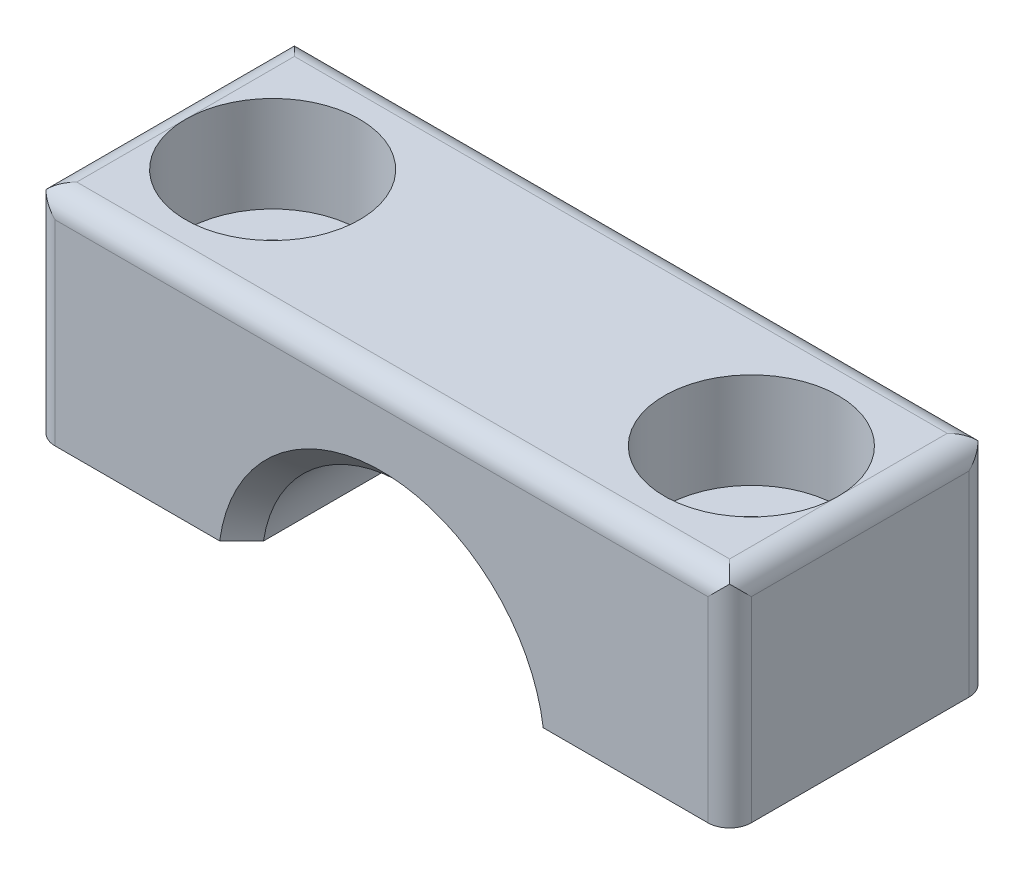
ISO-10303-21;
HEADER;
FILE_DESCRIPTION(('STEP AP214'),'2;1');
FILE_NAME('part.step','',(''),(''),'','','');
FILE_SCHEMA(('AUTOMOTIVE_DESIGN { 1 0 10303 214 1 1 1 1 }'));
ENDSEC;
DATA;
#1=APPLICATION_CONTEXT('core data for automotive mechanical design processes');
#2=APPLICATION_PROTOCOL_DEFINITION('international standard','automotive_design',2000,#1);
#3=PRODUCT_CONTEXT('',#1,'mechanical');
#4=PRODUCT('Part','Part','',(#3));
#5=PRODUCT_RELATED_PRODUCT_CATEGORY('part','',(#4));
#6=PRODUCT_DEFINITION_FORMATION('','',#4);
#7=PRODUCT_DEFINITION_CONTEXT('part definition',#1,'design');
#8=PRODUCT_DEFINITION('design','',#6,#7);
#9=PRODUCT_DEFINITION_SHAPE('','',#8);
#10=(LENGTH_UNIT() NAMED_UNIT(*) SI_UNIT(.MILLI.,.METRE.));
#11=(NAMED_UNIT(*) PLANE_ANGLE_UNIT() SI_UNIT($,.RADIAN.));
#12=(NAMED_UNIT(*) SI_UNIT($,.STERADIAN.) SOLID_ANGLE_UNIT());
#13=UNCERTAINTY_MEASURE_WITH_UNIT(LENGTH_MEASURE(1.E-05),#10,'distance_accuracy_value','');
#14=(GEOMETRIC_REPRESENTATION_CONTEXT(3) GLOBAL_UNCERTAINTY_ASSIGNED_CONTEXT((#13)) GLOBAL_UNIT_ASSIGNED_CONTEXT((#10,
#11,#12)) REPRESENTATION_CONTEXT('',''));
#15=CARTESIAN_POINT('',(0.,0.,0.));
#16=DIRECTION('',(0.,0.,1.));
#17=DIRECTION('',(1.,0.,0.));
#18=AXIS2_PLACEMENT_3D('',#15,#16,#17);
#19=CARTESIAN_POINT('',(-15.,31.,6.));
#20=DIRECTION('',(0.,0.,-1.));
#21=DIRECTION('',(-1.,0.,0.));
#22=AXIS2_PLACEMENT_3D('',#19,#20,#21);
#23=PLANE('',#22);
#24=DIRECTION('',(-1.,0.,0.));
#25=VECTOR('',#24,1.);
#26=CARTESIAN_POINT('',(15.,21.,6.));
#27=LINE('',#26,#25);
#28=CARTESIAN_POINT('',(15.,21.,6.));
#29=VERTEX_POINT('',#28);
#30=CARTESIAN_POINT('',(7.43303437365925,21.,6.));
#31=VERTEX_POINT('',#30);
#32=EDGE_CURVE('E7',#29,#31,#27,.T.);
#33=ORIENTED_EDGE('',*,*,#32,.F.);
#34=DIRECTION('',(0.,-1.,0.));
#35=VECTOR('',#34,1.);
#36=CARTESIAN_POINT('',(15.,30.,6.));
#37=LINE('',#36,#35);
#38=CARTESIAN_POINT('',(15.,30.,6.));
#39=VERTEX_POINT('',#38);
#40=EDGE_CURVE('E14',#39,#29,#37,.T.);
#41=ORIENTED_EDGE('',*,*,#40,.F.);
#42=DIRECTION('',(-1.,0.,0.));
#43=VECTOR('',#42,1.);
#44=CARTESIAN_POINT('',(15.,30.,6.));
#45=LINE('',#44,#43);
#46=CARTESIAN_POINT('',(-15.,30.,6.));
#47=VERTEX_POINT('',#46);
#48=EDGE_CURVE('E21',#39,#47,#45,.T.);
#49=ORIENTED_EDGE('',*,*,#48,.T.);
#50=DIRECTION('',(0.,-1.,0.));
#51=VECTOR('',#50,1.);
#52=CARTESIAN_POINT('',(-15.,30.,6.));
#53=LINE('',#52,#51);
#54=CARTESIAN_POINT('',(-15.,21.,6.));
#55=VERTEX_POINT('',#54);
#56=EDGE_CURVE('E28',#47,#55,#53,.T.);
#57=ORIENTED_EDGE('',*,*,#56,.T.);
#58=DIRECTION('',(-1.,0.,0.));
#59=VECTOR('',#58,1.);
#60=CARTESIAN_POINT('',(-7.43303437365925,21.,6.));
#61=LINE('',#60,#59);
#62=CARTESIAN_POINT('',(-7.43303437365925,21.,6.));
#63=VERTEX_POINT('',#62);
#64=EDGE_CURVE('E35',#63,#55,#61,.T.);
#65=ORIENTED_EDGE('',*,*,#64,.F.);
#66=CARTESIAN_POINT('',(0.,20.,6.));
#67=DIRECTION('',(0.,0.,-1.));
#68=DIRECTION('',(-0.991071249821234,0.133333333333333,0.));
#69=AXIS2_PLACEMENT_3D('',#66,#67,#68);
#70=CIRCLE('',#69,7.5);
#71=EDGE_CURVE('E42',#63,#31,#70,.T.);
#72=ORIENTED_EDGE('',*,*,#71,.T.);
#73=EDGE_LOOP('',(#33,#41,#49,#57,#65,#72));
#74=FACE_BOUND('',#73,.T.);
#75=ADVANCED_FACE('F48',(#74),#23,.F.);
#76=CARTESIAN_POINT('',(28.,21.,12.));
#77=DIRECTION('',(0.,-1.,0.));
#78=DIRECTION('',(0.,0.,-1.));
#79=AXIS2_PLACEMENT_3D('',#76,#77,#78);
#80=PLANE('',#79);
#81=CARTESIAN_POINT('',(11.,21.,0.));
#82=DIRECTION('',(0.,-1.,0.));
#83=DIRECTION('',(0.,0.,-1.));
#84=AXIS2_PLACEMENT_3D('',#81,#82,#83);
#85=CIRCLE('',#84,2.25);
#86=CARTESIAN_POINT('',(11.,21.,-2.25));
#87=VERTEX_POINT('',#86);
#88=EDGE_CURVE('E59',#87,#87,#85,.T.);
#89=ORIENTED_EDGE('',*,*,#88,.F.);
#90=EDGE_LOOP('',(#89));
#91=FACE_BOUND('',#90,.T.);
#92=ORIENTED_EDGE('',*,*,#32,.T.);
#93=CARTESIAN_POINT('',(6.42261212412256,21.,4.99999588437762));
#94=CARTESIAN_POINT('',(6.43665071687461,20.9999999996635,5.01386734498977));
#95=CARTESIAN_POINT('',(6.4506887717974,20.9999999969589,5.02773934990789));
#96=CARTESIAN_POINT('',(6.47876811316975,20.9999999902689,5.05548866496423));
#97=CARTESIAN_POINT('',(6.49280939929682,20.9999999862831,5.06936597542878));
#98=CARTESIAN_POINT('',(6.52089387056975,20.99999998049,5.09712454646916));
#99=CARTESIAN_POINT('',(6.53493705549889,20.9999999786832,5.11100580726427));
#100=CARTESIAN_POINT('',(6.56302399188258,20.9999999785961,5.13877092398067));
#101=CARTESIAN_POINT('',(6.57706774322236,20.9999999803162,5.15265478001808));
#102=CARTESIAN_POINT('',(6.6051544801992,20.9999999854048,5.18042373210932));
#103=CARTESIAN_POINT('',(6.61919746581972,20.9999999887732,5.19430882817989));
#104=CARTESIAN_POINT('',(6.64728133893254,20.9999999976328,5.22207890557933));
#105=CARTESIAN_POINT('',(6.66132222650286,21.0000000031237,5.23596388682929));
#106=CARTESIAN_POINT('',(6.68940209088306,20.9999999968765,5.26373388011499));
#107=CARTESIAN_POINT('',(6.70344106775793,20.9999999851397,5.277618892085));
#108=CARTESIAN_POINT('',(6.73151805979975,20.9999999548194,5.30538985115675));
#109=CARTESIAN_POINT('',(6.74555607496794,20.999999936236,5.31927579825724));
#110=CARTESIAN_POINT('',(6.7736309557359,20.9999999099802,5.34704840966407));
#111=CARTESIAN_POINT('',(6.78766782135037,20.9999999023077,5.36093507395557));
#112=CARTESIAN_POINT('',(6.81574021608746,20.9999999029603,5.38870890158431));
#113=CARTESIAN_POINT('',(6.82977574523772,20.999999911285,5.40259606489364));
#114=CARTESIAN_POINT('',(6.85784528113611,20.9999999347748,5.43037067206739));
#115=CARTESIAN_POINT('',(6.87187928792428,20.9999999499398,5.44425811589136));
#116=CARTESIAN_POINT('',(6.89994559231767,20.9999999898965,5.47203306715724));
#117=CARTESIAN_POINT('',(6.9139778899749,21.0000000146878,5.48592057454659));
#118=CARTESIAN_POINT('',(6.94204069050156,20.9999999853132,5.51369552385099));
#119=CARTESIAN_POINT('',(6.95607119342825,20.9999999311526,5.52758296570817));
#120=CARTESIAN_POINT('',(6.98413067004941,20.9999997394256,5.55535801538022));
#121=CARTESIAN_POINT('',(6.99815964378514,20.9999996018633,5.5692456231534));
#122=CARTESIAN_POINT('',(7.02621640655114,20.9999993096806,5.59702132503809));
#123=CARTESIAN_POINT('',(7.04024419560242,20.9999991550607,5.61090941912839));
#124=CARTESIAN_POINT('',(7.06829893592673,20.9999988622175,5.63868641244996));
#125=CARTESIAN_POINT('',(7.08232588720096,20.9999987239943,5.65257531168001));
#126=CARTESIAN_POINT('',(7.11037929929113,20.9999984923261,5.68035423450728));
#127=CARTESIAN_POINT('',(7.12440576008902,20.9999983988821,5.69424425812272));
#128=CARTESIAN_POINT('',(7.15245853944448,20.9999982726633,5.72202574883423));
#129=CARTESIAN_POINT('',(7.16648485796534,20.9999982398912,5.73591721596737));
#130=CARTESIAN_POINT('',(7.19453770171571,20.9999982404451,5.76370191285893));
#131=CARTESIAN_POINT('',(7.20856422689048,20.9999982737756,5.77759514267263));
#132=CARTESIAN_POINT('',(7.2366178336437,20.9999984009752,5.80538368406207));
#133=CARTESIAN_POINT('',(7.25064491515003,20.9999984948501,5.81927899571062));
#134=CARTESIAN_POINT('',(7.27869998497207,20.9999987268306,5.84707201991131));
#135=CARTESIAN_POINT('',(7.29272797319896,20.9999988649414,5.86096973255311));
#136=CARTESIAN_POINT('',(7.32078520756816,20.9999991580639,5.88876787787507));
#137=CARTESIAN_POINT('',(7.33481445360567,20.999999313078,5.90266831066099));
#138=CARTESIAN_POINT('',(7.36287455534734,20.999999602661,5.93047221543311));
#139=CARTESIAN_POINT('',(7.37690541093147,20.9999997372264,5.94437568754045));
#140=CARTESIAN_POINT('',(7.40496908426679,20.9999999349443,5.97218599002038));
#141=CARTESIAN_POINT('',(7.4190019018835,20.9999999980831,5.98609282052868));
#142=CARTESIAN_POINT('',(7.43303437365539,21.,5.99999999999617));
#143=B_SPLINE_CURVE_WITH_KNOTS('',3,(#93,#94,#95,#96,#97,#98,#99,#100,#101,#102,#103,#104,#105,
#106,#107,#108,#109,#110,#111,#112,#113,#114,#115,#116,#117,#118,#119,#120,#121,#122,#123,#124,
#125,#126,#127,#128,#129,#130,#131,#132,#133,#134,#135,#136,#137,#138,#139,#140,#141,#142),
.UNSPECIFIED.,.F.,.F.,(4,2,2,2,2,2,2,2,2,2,2,2,2,2,2,2,2,2,2,2,2,2,2,2,4),(0.,
0.0592072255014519,0.118432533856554,0.17767022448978,0.236914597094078,0.296159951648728,
0.355400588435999,0.414637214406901,0.473873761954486,0.533109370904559,0.59234318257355,
0.651574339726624,0.710801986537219,0.77002566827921,0.829246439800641,0.888465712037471,
0.947684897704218,1.00690541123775,1.06612866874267,1.12535608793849,1.18458908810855,
1.24382909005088,1.30307751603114,1.36233578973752,1.42160533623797),.UNSPECIFIED.);
#144=CARTESIAN_POINT('',(6.42261628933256,21.,5.));
#145=VERTEX_POINT('',#144);
#146=EDGE_CURVE('E63',#145,#31,#143,.T.);
#147=ORIENTED_EDGE('',*,*,#146,.F.);
#148=DIRECTION('',(0.,0.,1.));
#149=VECTOR('',#148,1.);
#150=CARTESIAN_POINT('',(6.42261628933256,21.,-5.));
#151=LINE('',#150,#149);
#152=CARTESIAN_POINT('',(6.42261628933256,21.,-5.));
#153=VERTEX_POINT('',#152);
#154=EDGE_CURVE('E81',#153,#145,#151,.T.);
#155=ORIENTED_EDGE('',*,*,#154,.F.);
#156=CARTESIAN_POINT('',(7.43303437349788,21.,-5.99999999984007));
#157=CARTESIAN_POINT('',(7.41198442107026,20.9999999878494,-5.97913799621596));
#158=CARTESIAN_POINT('',(7.39093369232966,20.9999998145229,-5.95827677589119));
#159=CARTESIAN_POINT('',(7.34884059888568,20.9999993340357,-5.91656583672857));
#160=CARTESIAN_POINT('',(7.32779823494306,20.9999990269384,-5.89571611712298));
#161=CARTESIAN_POINT('',(7.28571913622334,20.9999984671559,-5.85402557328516));
#162=CARTESIAN_POINT('',(7.26468240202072,20.9999982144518,-5.83318474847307));
#163=CARTESIAN_POINT('',(7.22261183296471,20.9999978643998,-5.79150938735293));
#164=CARTESIAN_POINT('',(7.20157799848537,20.9999977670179,-5.77067485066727));
#165=CARTESIAN_POINT('',(7.15951050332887,20.9999977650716,-5.72900945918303));
#166=CARTESIAN_POINT('',(7.13847684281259,20.9999978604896,-5.70817860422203));
#167=CARTESIAN_POINT('',(7.09640697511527,20.9999982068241,-5.66651796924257));
#168=CARTESIAN_POINT('',(7.07537076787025,20.9999984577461,-5.64568818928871));
#169=CARTESIAN_POINT('',(7.0332930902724,20.9999990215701,-5.60402709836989));
#170=CARTESIAN_POINT('',(7.01225161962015,20.9999993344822,-5.58319578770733));
#171=CARTESIAN_POINT('',(6.97016070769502,20.9999998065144,-5.5415290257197));
#172=CARTESIAN_POINT('',(6.94911126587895,20.99999996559,-5.52069357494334));
#173=CARTESIAN_POINT('',(6.90700328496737,21.0000000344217,-5.47901750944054));
#174=CARTESIAN_POINT('',(6.88594474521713,20.9999999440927,-5.45817689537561));
#175=CARTESIAN_POINT('',(6.84382122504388,20.999999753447,-5.41649327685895));
#176=CARTESIAN_POINT('',(6.82275624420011,20.9999996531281,-5.39565027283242));
#177=CARTESIAN_POINT('',(6.78062282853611,20.9999994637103,-5.35396494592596));
#178=CARTESIAN_POINT('',(6.75955439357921,20.999999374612,-5.33312262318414));
#179=CARTESIAN_POINT('',(6.71741705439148,20.9999992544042,-5.29144173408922));
#180=CARTESIAN_POINT('',(6.69634815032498,20.9999992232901,-5.27060316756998));
#181=CARTESIAN_POINT('',(6.65421286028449,20.9999992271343,-5.22893286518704));
#182=CARTESIAN_POINT('',(6.6331464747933,20.9999992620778,-5.20810112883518));
#183=CARTESIAN_POINT('',(6.59101921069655,20.9999993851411,-5.16644756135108));
#184=CARTESIAN_POINT('',(6.56995833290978,20.9999994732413,-5.14562572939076));
#185=CARTESIAN_POINT('',(6.52784507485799,20.9999996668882,-5.10399504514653));
#186=CARTESIAN_POINT('',(6.50679269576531,20.999999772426,-5.08318619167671));
#187=CARTESIAN_POINT('',(6.4646994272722,20.9999999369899,-5.04158453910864));
#188=CARTESIAN_POINT('',(6.44365853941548,20.9999999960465,-5.02079173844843));
#189=CARTESIAN_POINT('',(6.42261644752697,21.,-5.00000015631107));
#190=B_SPLINE_CURVE_WITH_KNOTS('',3,(#156,#157,#158,#159,#160,#161,#162,#163,#164,#165,#166,
#167,#168,#169,#170,#171,#172,#173,#174,#175,#176,#177,#178,#179,#180,#181,#182,#183,#184,#185,
#186,#187,#188,#189),.UNSPECIFIED.,.F.,.F.,(4,2,2,2,2,2,2,2,2,2,2,2,2,2,2,2,4),(0.,
0.0889095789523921,0.177777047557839,0.266613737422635,0.355430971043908,0.444240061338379,
0.533052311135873,0.62187901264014,0.710731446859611,0.79961417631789,0.888515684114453,
0.977423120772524,1.06632363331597,1.15520436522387,1.24405245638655,1.33285504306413,
1.42159925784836),.UNSPECIFIED.);
#191=CARTESIAN_POINT('',(7.43303437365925,21.,-6.));
#192=VERTEX_POINT('',#191);
#193=EDGE_CURVE('E85',#192,#153,#190,.T.);
#194=ORIENTED_EDGE('',*,*,#193,.F.);
#195=DIRECTION('',(1.,0.,0.));
#196=VECTOR('',#195,1.);
#197=CARTESIAN_POINT('',(7.43303437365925,21.,-6.));
#198=LINE('',#197,#196);
#199=CARTESIAN_POINT('',(15.,21.,-6.));
#200=VERTEX_POINT('',#199);
#201=EDGE_CURVE('E102',#192,#200,#198,.T.);
#202=ORIENTED_EDGE('',*,*,#201,.T.);
#203=CARTESIAN_POINT('',(15.0000000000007,21.,-5.00000000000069));
#204=DIRECTION('',(0.,-1.,0.));
#205=DIRECTION('',(0.,0.,-1.));
#206=AXIS2_PLACEMENT_3D('',#203,#204,#205);
#207=CIRCLE('',#206,0.999999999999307);
#208=CARTESIAN_POINT('',(16.,21.,-5.));
#209=VERTEX_POINT('',#208);
#210=EDGE_CURVE('E109',#200,#209,#207,.T.);
#211=ORIENTED_EDGE('',*,*,#210,.T.);
#212=DIRECTION('',(0.,0.,1.));
#213=VECTOR('',#212,1.);
#214=CARTESIAN_POINT('',(16.,21.,-5.));
#215=LINE('',#214,#213);
#216=CARTESIAN_POINT('',(16.,21.,5.));
#217=VERTEX_POINT('',#216);
#218=EDGE_CURVE('E116',#209,#217,#215,.T.);
#219=ORIENTED_EDGE('',*,*,#218,.T.);
#220=CARTESIAN_POINT('',(15.0000000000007,21.,5.00000000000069));
#221=DIRECTION('',(0.,-1.,0.));
#222=DIRECTION('',(1.,0.,-6.89226453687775E-13));
#223=AXIS2_PLACEMENT_3D('',#220,#221,#222);
#224=CIRCLE('',#223,0.999999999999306);
#225=EDGE_CURVE('E123',#217,#29,#224,.T.);
#226=ORIENTED_EDGE('',*,*,#225,.T.);
#227=EDGE_LOOP('',(#92,#147,#155,#194,#202,#211,#219,#226));
#228=FACE_BOUND('',#227,.T.);
#229=ADVANCED_FACE('F126',(#91,#228),#80,.T.);
#230=CARTESIAN_POINT('',(15.0000000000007,31.,5.00000000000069));
#231=DIRECTION('',(0.,-1.,0.));
#232=DIRECTION('',(0.,0.,-1.));
#233=AXIS2_PLACEMENT_3D('',#230,#231,#232);
#234=CYLINDRICAL_SURFACE('',#233,0.999999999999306);
#235=ORIENTED_EDGE('',*,*,#225,.F.);
#236=DIRECTION('',(0.,-1.,0.));
#237=VECTOR('',#236,1.);
#238=CARTESIAN_POINT('',(16.,30.,5.));
#239=LINE('',#238,#237);
#240=CARTESIAN_POINT('',(16.,30.,5.));
#241=VERTEX_POINT('',#240);
#242=EDGE_CURVE('E136',#241,#217,#239,.T.);
#243=ORIENTED_EDGE('',*,*,#242,.F.);
#244=CARTESIAN_POINT('',(16.,30.0000000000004,4.99999999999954));
#245=CARTESIAN_POINT('',(15.9999997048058,30.0162182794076,5.01621808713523));
#246=CARTESIAN_POINT('',(15.9996054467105,30.0324352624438,5.03243764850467));
#247=CARTESIAN_POINT('',(15.9980222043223,30.0649363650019,5.06494703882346));
#248=CARTESIAN_POINT('',(15.9968289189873,30.0812203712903,5.0812367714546));
#249=CARTESIAN_POINT('',(15.9936373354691,30.1137836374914,5.11381217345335));
#250=CARTESIAN_POINT('',(15.991637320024,30.1300628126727,5.1300977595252));
#251=CARTESIAN_POINT('',(15.9868302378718,30.1625444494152,5.16258999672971));
#252=CARTESIAN_POINT('',(15.9840240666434,30.1787469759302,5.17879671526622));
#253=CARTESIAN_POINT('',(15.9776115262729,30.2110033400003,5.21105685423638));
#254=CARTESIAN_POINT('',(15.9740086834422,30.227057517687,5.22711063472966));
#255=CARTESIAN_POINT('',(15.9660180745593,30.2589445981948,5.25899243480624));
#256=CARTESIAN_POINT('',(15.9616364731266,30.2747782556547,5.27482124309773));
#257=CARTESIAN_POINT('',(15.9521126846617,30.306153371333,5.30618150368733));
#258=CARTESIAN_POINT('',(15.9469792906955,30.3216961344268,5.32171431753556));
#259=CARTESIAN_POINT('',(15.93598194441,30.3524117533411,5.35241997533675));
#260=CARTESIAN_POINT('',(15.9301294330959,30.3675867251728,5.36759479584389));
#261=CARTESIAN_POINT('',(15.9177356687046,30.3975240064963,5.3975160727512));
#262=CARTESIAN_POINT('',(15.9112077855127,30.4122889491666,5.41226542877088));
#263=CARTESIAN_POINT('',(15.8974801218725,30.4414235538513,5.44134344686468));
#264=CARTESIAN_POINT('',(15.890292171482,30.4557958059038,5.45567509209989));
#265=CARTESIAN_POINT('',(15.8752326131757,30.4841605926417,5.48396434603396));
#266=CARTESIAN_POINT('',(15.8673702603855,30.4981556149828,5.49792437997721));
#267=CARTESIAN_POINT('',(15.8509403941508,30.5257881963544,5.52550539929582));
#268=CARTESIAN_POINT('',(15.8423794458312,30.539427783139,5.53912825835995));
#269=CARTESIAN_POINT('',(15.8245191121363,30.56637030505,5.56606367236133));
#270=CARTESIAN_POINT('',(15.8152234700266,30.5796745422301,5.57937740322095));
#271=CARTESIAN_POINT('',(15.7958505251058,30.6059680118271,5.60571355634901));
#272=CARTESIAN_POINT('',(15.7857739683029,30.6189575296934,5.61873624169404));
#273=CARTESIAN_POINT('',(15.7647860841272,30.644642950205,5.64449909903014));
#274=CARTESIAN_POINT('',(15.7538723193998,30.6573378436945,5.65723829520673));
#275=CARTESIAN_POINT('',(15.7311505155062,30.6824572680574,5.68242852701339));
#276=CARTESIAN_POINT('',(15.719336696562,30.6948792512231,5.6948768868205));
#277=CARTESIAN_POINT('',(15.7071067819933,30.707106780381,5.70710678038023));
#278=B_SPLINE_CURVE_WITH_KNOTS('',3,(#244,#245,#246,#247,#248,#249,#250,#251,#252,#253,#254,
#255,#256,#257,#258,#259,#260,#261,#262,#263,#264,#265,#266,#267,#268,#269,#270,#271,#272,#273,
#274,#275,#276,#277),.UNSPECIFIED.,.F.,.F.,(4,2,2,2,2,2,2,2,2,2,2,2,2,2,2,2,4),(0.,
0.0688047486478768,0.137982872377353,0.207309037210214,0.276558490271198,0.345507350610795,
0.413932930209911,0.481614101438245,0.548331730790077,0.613917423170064,0.678498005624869,
0.742302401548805,0.805564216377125,0.868522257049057,0.931420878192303,0.994510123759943,
1.0580456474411),.UNSPECIFIED.);
#279=CARTESIAN_POINT('',(15.7071067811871,30.7071067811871,5.70710678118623));
#280=VERTEX_POINT('',#279);
#281=EDGE_CURVE('E140',#241,#280,#278,.T.);
#282=ORIENTED_EDGE('',*,*,#281,.T.);
#283=CARTESIAN_POINT('',(15.7071067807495,30.7071067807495,5.70710678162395));
#284=CARTESIAN_POINT('',(15.6948768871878,30.6948792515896,5.71933669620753));
#285=CARTESIAN_POINT('',(15.6824285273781,30.6824572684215,5.73115051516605));
#286=CARTESIAN_POINT('',(15.6572382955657,30.657337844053,5.75387231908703));
#287=CARTESIAN_POINT('',(15.644499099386,30.6446429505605,5.76478608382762));
#288=CARTESIAN_POINT('',(15.6187362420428,30.6189575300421,5.78577396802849));
#289=CARTESIAN_POINT('',(15.605713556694,30.6059680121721,5.79585052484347));
#290=CARTESIAN_POINT('',(15.5793774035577,30.579674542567,5.81522346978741));
#291=CARTESIAN_POINT('',(15.5660636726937,30.5663703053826,5.82451911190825));
#292=CARTESIAN_POINT('',(15.539128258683,30.5394277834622,5.84237944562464));
#293=CARTESIAN_POINT('',(15.5255053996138,30.5257881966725,5.85094039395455));
#294=CARTESIAN_POINT('',(15.4979243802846,30.4981556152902,5.8673702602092));
#295=CARTESIAN_POINT('',(15.4839643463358,30.4841605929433,5.87523261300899));
#296=CARTESIAN_POINT('',(15.4556750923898,30.4557958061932,5.89029217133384));
#297=CARTESIAN_POINT('',(15.4413434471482,30.4414235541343,5.89748012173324));
#298=CARTESIAN_POINT('',(15.412265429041,30.412288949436,5.91120778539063));
#299=CARTESIAN_POINT('',(15.3975160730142,30.3975240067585,5.91773566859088));
#300=CARTESIAN_POINT('',(15.3675947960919,30.3675867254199,5.93012943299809));
#301=CARTESIAN_POINT('',(15.3524199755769,30.3524117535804,5.93598194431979));
#302=CARTESIAN_POINT('',(15.3217143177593,30.3216961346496,5.94697929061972));
#303=CARTESIAN_POINT('',(15.3061815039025,30.3061533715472,5.95211268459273));
#304=CARTESIAN_POINT('',(15.2748212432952,30.2747782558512,5.96163647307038));
#305=CARTESIAN_POINT('',(15.2589924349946,30.2589445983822,5.96601807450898));
#306=CARTESIAN_POINT('',(15.2271106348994,30.2270575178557,5.97400868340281));
#307=CARTESIAN_POINT('',(15.2110568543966,30.2110033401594,5.97761152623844));
#308=CARTESIAN_POINT('',(15.178796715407,30.17874697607,5.98402406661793));
#309=CARTESIAN_POINT('',(15.1625899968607,30.1625444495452,5.98683023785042));
#310=CARTESIAN_POINT('',(15.1300977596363,30.1300628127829,5.99163732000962));
#311=CARTESIAN_POINT('',(15.1138121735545,30.1137836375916,5.99363733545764));
#312=CARTESIAN_POINT('',(15.0812367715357,30.0812203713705,5.99682891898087));
#313=CARTESIAN_POINT('',(15.0649470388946,30.0649363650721,5.99802220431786));
#314=CARTESIAN_POINT('',(15.0324376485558,30.0324352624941,5.99960544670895));
#315=CARTESIAN_POINT('',(15.0162180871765,30.016218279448,5.99999970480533));
#316=CARTESIAN_POINT('',(15.0000000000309,30.0000000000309,6.));
#317=B_SPLINE_CURVE_WITH_KNOTS('',3,(#283,#284,#285,#286,#287,#288,#289,#290,#291,#292,#293,
#294,#295,#296,#297,#298,#299,#300,#301,#302,#303,#304,#305,#306,#307,#308,#309,#310,#311,#312,
#313,#314,#315,#316),.UNSPECIFIED.,.F.,.F.,(4,2,2,2,2,2,2,2,2,2,2,2,2,2,2,2,4),(0.,
0.0635355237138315,0.126624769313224,0.189523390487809,0.252481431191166,0.315743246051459,
0.379547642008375,0.444128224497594,0.509713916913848,0.576431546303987,0.644112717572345,
0.712538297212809,0.781487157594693,0.850736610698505,0.920062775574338,0.989240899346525,
1.05804564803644),.UNSPECIFIED.);
#318=EDGE_CURVE('E155',#280,#39,#317,.T.);
#319=ORIENTED_EDGE('',*,*,#318,.T.);
#320=ORIENTED_EDGE('',*,*,#40,.T.);
#321=EDGE_LOOP('',(#235,#243,#282,#319,#320));
#322=FACE_BOUND('',#321,.T.);
#323=ADVANCED_FACE('F169',(#322),#234,.T.);
#324=CARTESIAN_POINT('',(32.,30.0000000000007,5.00000000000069));
#325=DIRECTION('',(-1.,0.,0.));
#326=DIRECTION('',(0.,0.,1.));
#327=AXIS2_PLACEMENT_3D('',#324,#325,#326);
#328=CYLINDRICAL_SURFACE('',#327,0.999999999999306);
#329=CARTESIAN_POINT('',(15.0000000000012,31.,5.00000000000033));
#330=CARTESIAN_POINT('',(15.0162180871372,30.9999997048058,5.0162182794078));
#331=CARTESIAN_POINT('',(15.0324376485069,30.9996054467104,5.03243526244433));
#332=CARTESIAN_POINT('',(15.0649470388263,30.9980222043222,5.06493636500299));
#333=CARTESIAN_POINT('',(15.0812367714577,30.9968289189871,5.08122037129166));
#334=CARTESIAN_POINT('',(15.113812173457,30.9936373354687,5.11378363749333));
#335=CARTESIAN_POINT('',(15.1300977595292,30.9916373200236,5.13006281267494));
#336=CARTESIAN_POINT('',(15.1625899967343,30.9868302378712,5.16254444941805));
#337=CARTESIAN_POINT('',(15.1787967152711,30.9840240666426,5.17874697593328));
#338=CARTESIAN_POINT('',(15.2110568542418,30.9776115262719,5.21100334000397));
#339=CARTESIAN_POINT('',(15.2271106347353,30.9740086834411,5.22705751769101));
#340=CARTESIAN_POINT('',(15.2589924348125,30.9660180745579,5.25894459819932));
#341=CARTESIAN_POINT('',(15.2748212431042,30.961636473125,5.2747782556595));
#342=CARTESIAN_POINT('',(15.3061815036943,30.9521126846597,5.3061533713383));
#343=CARTESIAN_POINT('',(15.3217143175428,30.9469792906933,5.32169613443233));
#344=CARTESIAN_POINT('',(15.3524199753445,30.9359819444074,5.35241175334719));
#345=CARTESIAN_POINT('',(15.3675947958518,30.9301294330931,5.36758672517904));
#346=CARTESIAN_POINT('',(15.3975160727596,30.9177356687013,5.397524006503));
#347=CARTESIAN_POINT('',(15.4122654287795,30.9112077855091,5.41228894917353));
#348=CARTESIAN_POINT('',(15.4413434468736,30.8974801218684,5.4414235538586));
#349=CARTESIAN_POINT('',(15.455675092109,30.8902921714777,5.45579580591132));
#350=CARTESIAN_POINT('',(15.4839643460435,30.8752326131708,5.48416059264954));
#351=CARTESIAN_POINT('',(15.4979243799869,30.8673702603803,5.49815561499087));
#352=CARTESIAN_POINT('',(15.5255053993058,30.850940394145,5.52578819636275));
#353=CARTESIAN_POINT('',(15.53912825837,30.8423794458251,5.53942778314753));
#354=CARTESIAN_POINT('',(15.5660636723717,30.8245191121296,5.5663703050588));
#355=CARTESIAN_POINT('',(15.5793774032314,30.8152234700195,5.57967454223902));
#356=CARTESIAN_POINT('',(15.6057135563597,30.7958505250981,5.60596801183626));
#357=CARTESIAN_POINT('',(15.6187362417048,30.7857739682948,5.61895752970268));
#358=CARTESIAN_POINT('',(15.6444990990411,30.7647860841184,5.64464295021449));
#359=CARTESIAN_POINT('',(15.6572382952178,30.7538723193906,5.65733784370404));
#360=CARTESIAN_POINT('',(15.6824285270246,30.7311505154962,5.68245726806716));
#361=CARTESIAN_POINT('',(15.6948768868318,30.7193366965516,5.69487925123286));
#362=CARTESIAN_POINT('',(15.7071067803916,30.7071067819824,5.70710678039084));
#363=B_SPLINE_CURVE_WITH_KNOTS('',3,(#329,#330,#331,#332,#333,#334,#335,#336,#337,#338,#339,
#340,#341,#342,#343,#344,#345,#346,#347,#348,#349,#350,#351,#352,#353,#354,#355,#356,#357,#358,
#359,#360,#361,#362),.UNSPECIFIED.,.F.,.F.,(4,2,2,2,2,2,2,2,2,2,2,2,2,2,2,2,4),(0.,
0.0688047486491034,0.137982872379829,0.207309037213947,0.27655849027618,0.345507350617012,
0.413932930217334,0.481614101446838,0.548331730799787,0.613917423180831,0.678498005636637,
0.742302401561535,0.805564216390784,0.868522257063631,0.931420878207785,0.994510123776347,
1.05804564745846),.UNSPECIFIED.);
#364=CARTESIAN_POINT('',(15.0000000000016,31.,5.));
#365=VERTEX_POINT('',#364);
#366=EDGE_CURVE('E175',#365,#280,#363,.T.);
#367=ORIENTED_EDGE('',*,*,#366,.F.);
#368=DIRECTION('',(-1.,0.,0.));
#369=VECTOR('',#368,1.);
#370=CARTESIAN_POINT('',(15.0000000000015,31.,5.));
#371=LINE('',#370,#369);
#372=CARTESIAN_POINT('',(-15.,31.,5.));
#373=VERTEX_POINT('',#372);
#374=EDGE_CURVE('E193',#365,#373,#371,.T.);
#375=ORIENTED_EDGE('',*,*,#374,.T.);
#376=CARTESIAN_POINT('',(-15.70710678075,30.707106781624,5.7071067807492));
#377=CARTESIAN_POINT('',(-15.6948768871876,30.7193366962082,5.69487925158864));
#378=CARTESIAN_POINT('',(-15.6824285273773,30.7311505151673,5.68245726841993));
#379=CARTESIAN_POINT('',(-15.6572382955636,30.7538723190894,5.65733784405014));
#380=CARTESIAN_POINT('',(-15.6444990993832,30.7647860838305,5.64464295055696));
#381=CARTESIAN_POINT('',(-15.6187362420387,30.7857739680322,5.6189575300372));
#382=CARTESIAN_POINT('',(-15.6057135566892,30.7958505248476,5.6059680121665));
#383=CARTESIAN_POINT('',(-15.5793774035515,30.8152234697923,5.57967454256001));
#384=CARTESIAN_POINT('',(-15.5660636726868,30.8245191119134,5.56637030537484));
#385=CARTESIAN_POINT('',(-15.5391282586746,30.8423794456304,5.53942778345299));
#386=CARTESIAN_POINT('',(-15.5255053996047,30.8509403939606,5.52578819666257));
#387=CARTESIAN_POINT('',(-15.497924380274,30.8673702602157,5.49815561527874));
#388=CARTESIAN_POINT('',(-15.4839643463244,30.8752326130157,5.48416059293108));
#389=CARTESIAN_POINT('',(-15.4556750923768,30.8902921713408,5.4557958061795));
#390=CARTESIAN_POINT('',(-15.4413434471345,30.8974801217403,5.44142355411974));
#391=CARTESIAN_POINT('',(-15.4122654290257,30.9112077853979,5.41228894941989));
#392=CARTESIAN_POINT('',(-15.3975160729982,30.9177356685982,5.3975240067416));
#393=CARTESIAN_POINT('',(-15.3675947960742,30.9301294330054,5.36758672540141));
#394=CARTESIAN_POINT('',(-15.3524199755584,30.935981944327,5.35241175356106));
#395=CARTESIAN_POINT('',(-15.3217143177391,30.9469792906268,5.32169613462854));
#396=CARTESIAN_POINT('',(-15.3061815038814,30.9521126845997,5.30615337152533));
#397=CARTESIAN_POINT('',(-15.2748212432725,30.9616364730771,5.27477825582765));
#398=CARTESIAN_POINT('',(-15.258992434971,30.9660180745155,5.25894459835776));
#399=CARTESIAN_POINT('',(-15.2271106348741,30.9740086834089,5.22705751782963));
#400=CARTESIAN_POINT('',(-15.2110568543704,30.9776115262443,5.21100334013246));
#401=CARTESIAN_POINT('',(-15.1787967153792,30.9840240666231,5.17874697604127));
#402=CARTESIAN_POINT('',(-15.162589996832,30.9868302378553,5.16254444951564));
#403=CARTESIAN_POINT('',(-15.1300977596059,30.9916373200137,5.1300628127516));
#404=CARTESIAN_POINT('',(-15.1138121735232,30.9936373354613,5.11378363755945));
#405=CARTESIAN_POINT('',(-15.0812367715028,30.9968289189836,5.08122037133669));
#406=CARTESIAN_POINT('',(-15.0649470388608,30.9980222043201,5.06493636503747));
#407=CARTESIAN_POINT('',(-15.0324376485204,30.9996054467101,5.03243526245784));
#408=CARTESIAN_POINT('',(-15.0162180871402,30.9999997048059,5.01621827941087));
#409=CARTESIAN_POINT('',(-14.9999999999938,31.,4.99999999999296));
#410=B_SPLINE_CURVE_WITH_KNOTS('',3,(#376,#377,#378,#379,#380,#381,#382,#383,#384,#385,#386,
#387,#388,#389,#390,#391,#392,#393,#394,#395,#396,#397,#398,#399,#400,#401,#402,#403,#404,#405,
#406,#407,#408,#409),.UNSPECIFIED.,.F.,.F.,(4,2,2,2,2,2,2,2,2,2,2,2,2,2,2,2,4),(0.,
0.0635355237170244,0.126624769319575,0.189523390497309,0.252481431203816,0.315743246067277,
0.379547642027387,0.444128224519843,0.509713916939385,0.576431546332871,0.644112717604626,
0.712538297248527,0.781487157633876,0.850736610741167,0.92006277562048,0.989240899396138,
1.05804564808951),.UNSPECIFIED.);
#411=CARTESIAN_POINT('',(-15.7071067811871,30.7071067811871,5.70710678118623));
#412=VERTEX_POINT('',#411);
#413=EDGE_CURVE('E197',#412,#373,#410,.T.);
#414=ORIENTED_EDGE('',*,*,#413,.F.);
#415=CARTESIAN_POINT('',(-15.,30.,6.));
#416=CARTESIAN_POINT('',(-15.0162180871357,30.0162182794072,5.99999970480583));
#417=CARTESIAN_POINT('',(-15.0324376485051,30.0324352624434,5.99960544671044));
#418=CARTESIAN_POINT('',(-15.0649470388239,30.0649363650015,5.99802220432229));
#419=CARTESIAN_POINT('',(-15.081236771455,30.0812203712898,5.99682891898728));
#420=CARTESIAN_POINT('',(-15.1138121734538,30.1137836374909,5.99363733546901));
#421=CARTESIAN_POINT('',(-15.1300977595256,30.1300628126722,5.99163732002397));
#422=CARTESIAN_POINT('',(-15.1625899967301,30.1625444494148,5.98683023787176));
#423=CARTESIAN_POINT('',(-15.1787967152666,30.1787469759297,5.98402406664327));
#424=CARTESIAN_POINT('',(-15.2110568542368,30.2110033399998,5.97761152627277));
#425=CARTESIAN_POINT('',(-15.2271106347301,30.2270575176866,5.97400868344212));
#426=CARTESIAN_POINT('',(-15.2589924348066,30.2589445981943,5.96601807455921));
#427=CARTESIAN_POINT('',(-15.2748212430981,30.2747782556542,5.96163647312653));
#428=CARTESIAN_POINT('',(-15.3061815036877,30.3061533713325,5.95211268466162));
#429=CARTESIAN_POINT('',(-15.3217143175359,30.3216961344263,5.94697929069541));
#430=CARTESIAN_POINT('',(-15.3524199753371,30.3524117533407,5.93598194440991));
#431=CARTESIAN_POINT('',(-15.3675947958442,30.3675867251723,5.9301294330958));
#432=CARTESIAN_POINT('',(-15.3975160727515,30.3975240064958,5.9177356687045));
#433=CARTESIAN_POINT('',(-15.4122654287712,30.4122889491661,5.91120778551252));
#434=CARTESIAN_POINT('',(-15.441343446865,30.4414235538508,5.89748012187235));
#435=CARTESIAN_POINT('',(-15.4556750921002,30.4557958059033,5.89029217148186));
#436=CARTESIAN_POINT('',(-15.4839643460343,30.4841605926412,5.87523261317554));
#437=CARTESIAN_POINT('',(-15.4979243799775,30.4981556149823,5.86737026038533));
#438=CARTESIAN_POINT('',(-15.5255053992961,30.5257881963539,5.8509403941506));
#439=CARTESIAN_POINT('',(-15.5391282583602,30.5394277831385,5.84237944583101));
#440=CARTESIAN_POINT('',(-15.5660636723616,30.5663703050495,5.82451911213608));
#441=CARTESIAN_POINT('',(-15.5793774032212,30.5796745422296,5.81522347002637));
#442=CARTESIAN_POINT('',(-15.6057135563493,30.6059680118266,5.79585052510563));
#443=CARTESIAN_POINT('',(-15.6187362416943,30.6189575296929,5.78577396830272));
#444=CARTESIAN_POINT('',(-15.6444990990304,30.6446429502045,5.76478608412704));
#445=CARTESIAN_POINT('',(-15.657238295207,30.6573378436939,5.75387231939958));
#446=CARTESIAN_POINT('',(-15.6824285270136,30.6824572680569,5.73115051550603));
#447=CARTESIAN_POINT('',(-15.6948768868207,30.6948792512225,5.71933669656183));
#448=CARTESIAN_POINT('',(-15.7071067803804,30.7071067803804,5.70710678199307));
#449=B_SPLINE_CURVE_WITH_KNOTS('',3,(#415,#416,#417,#418,#419,#420,#421,#422,#423,#424,#425,
#426,#427,#428,#429,#430,#431,#432,#433,#434,#435,#436,#437,#438,#439,#440,#441,#442,#443,#444,
#445,#446,#447,#448),.UNSPECIFIED.,.F.,.F.,(4,2,2,2,2,2,2,2,2,2,2,2,2,2,2,2,4),(0.,
0.068804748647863,0.137982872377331,0.207309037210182,0.276558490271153,0.345507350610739,
0.413932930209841,0.481614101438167,0.548331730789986,0.61391742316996,0.678498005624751,
0.742302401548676,0.80556421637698,0.868522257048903,0.931420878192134,0.99451012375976,
1.0580456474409),.UNSPECIFIED.);
#450=EDGE_CURVE('E211',#47,#412,#449,.T.);
#451=ORIENTED_EDGE('',*,*,#450,.F.);
#452=ORIENTED_EDGE('',*,*,#48,.F.);
#453=ORIENTED_EDGE('',*,*,#318,.F.);
#454=EDGE_LOOP('',(#367,#375,#414,#451,#452,#453));
#455=FACE_BOUND('',#454,.T.);
#456=ADVANCED_FACE('F236',(#455),#328,.T.);
#457=CARTESIAN_POINT('',(-15.0000000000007,31.,5.00000000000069));
#458=DIRECTION('',(0.,-1.,0.));
#459=DIRECTION('',(0.,0.,-1.));
#460=AXIS2_PLACEMENT_3D('',#457,#458,#459);
#461=CYLINDRICAL_SURFACE('',#460,0.999999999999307);
#462=CARTESIAN_POINT('',(-15.0000000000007,21.,5.00000000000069));
#463=DIRECTION('',(0.,-1.,0.));
#464=DIRECTION('',(6.99884594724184E-13,0.,1.));
#465=AXIS2_PLACEMENT_3D('',#462,#463,#464);
#466=CIRCLE('',#465,0.999999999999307);
#467=CARTESIAN_POINT('',(-16.,21.,5.));
#468=VERTEX_POINT('',#467);
#469=EDGE_CURVE('E245',#55,#468,#466,.T.);
#470=ORIENTED_EDGE('',*,*,#469,.F.);
#471=ORIENTED_EDGE('',*,*,#56,.F.);
#472=ORIENTED_EDGE('',*,*,#450,.T.);
#473=CARTESIAN_POINT('',(-15.7071067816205,30.7071067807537,5.70710678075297));
#474=CARTESIAN_POINT('',(-15.7193366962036,30.6948792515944,5.6948768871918));
#475=CARTESIAN_POINT('',(-15.7311505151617,30.6824572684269,5.68242852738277));
#476=CARTESIAN_POINT('',(-15.7538723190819,30.6573378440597,5.65723829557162));
#477=CARTESIAN_POINT('',(-15.7647860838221,30.6446429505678,5.64449909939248));
#478=CARTESIAN_POINT('',(-15.7857739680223,30.6189575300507,5.61873624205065));
#479=CARTESIAN_POINT('',(-15.795850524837,30.6059680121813,5.60571355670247));
#480=CARTESIAN_POINT('',(-15.8152234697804,30.5796745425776,5.57937740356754));
#481=CARTESIAN_POINT('',(-15.8245191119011,30.5663703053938,5.5660636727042));
#482=CARTESIAN_POINT('',(-15.8423794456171,30.5394277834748,5.53912825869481));
#483=CARTESIAN_POINT('',(-15.8509403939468,30.5257881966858,5.52550539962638));
#484=CARTESIAN_POINT('',(-15.8673702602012,30.4981556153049,5.49792438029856));
#485=CARTESIAN_POINT('',(-15.8752326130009,30.4841605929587,5.4839643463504));
#486=CARTESIAN_POINT('',(-15.8902921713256,30.4557958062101,5.45567509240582));
#487=CARTESIAN_POINT('',(-15.897480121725,30.4414235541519,5.44134344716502));
#488=CARTESIAN_POINT('',(-15.9112077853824,30.4122889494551,5.41226542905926));
#489=CARTESIAN_POINT('',(-15.9177356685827,30.3975240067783,5.39751607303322));
#490=CARTESIAN_POINT('',(-15.93012943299,30.3675867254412,5.3675947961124));
#491=CARTESIAN_POINT('',(-15.9359819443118,30.3524117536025,5.35241997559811));
#492=CARTESIAN_POINT('',(-15.946979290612,30.3216961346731,5.32171431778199));
#493=CARTESIAN_POINT('',(-15.9521126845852,30.3061533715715,5.30618150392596));
#494=CARTESIAN_POINT('',(-15.9616364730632,30.2747782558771,5.27482124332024));
#495=CARTESIAN_POINT('',(-15.9660180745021,30.2589445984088,5.2589924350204));
#496=CARTESIAN_POINT('',(-15.9740086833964,30.2270575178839,5.22711063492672));
#497=CARTESIAN_POINT('',(-15.9776115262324,30.2110033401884,5.21105685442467));
#498=CARTESIAN_POINT('',(-15.9840240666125,30.1787469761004,5.17879671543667));
#499=CARTESIAN_POINT('',(-15.9868302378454,30.1625444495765,5.1625899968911));
#500=CARTESIAN_POINT('',(-15.9916373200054,30.1300628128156,5.13009775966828));
#501=CARTESIAN_POINT('',(-15.9936373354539,30.1137836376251,5.11381217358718));
#502=CARTESIAN_POINT('',(-15.9968289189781,30.0812203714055,5.08123677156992));
#503=CARTESIAN_POINT('',(-15.9980222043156,30.0649363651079,5.06494703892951));
#504=CARTESIAN_POINT('',(-15.9996054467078,30.0324352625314,5.03243764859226));
#505=CARTESIAN_POINT('',(-15.9999997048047,30.016218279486,5.01621808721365));
#506=CARTESIAN_POINT('',(-16.,30.0000000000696,5.00000000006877));
#507=B_SPLINE_CURVE_WITH_KNOTS('',3,(#473,#474,#475,#476,#477,#478,#479,#480,#481,#482,#483,
#484,#485,#486,#487,#488,#489,#490,#491,#492,#493,#494,#495,#496,#497,#498,#499,#500,#501,#502,
#503,#504,#505,#506),.UNSPECIFIED.,.F.,.F.,(4,2,2,2,2,2,2,2,2,2,2,2,2,2,2,2,4),(0.,
0.063535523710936,0.126624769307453,0.18952339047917,0.252481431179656,0.315743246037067,
0.379547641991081,0.444128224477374,0.509713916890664,0.576431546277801,0.644112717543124,
0.712538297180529,0.781487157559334,0.850736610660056,0.920062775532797,0.989240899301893,
1.05804564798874),.UNSPECIFIED.);
#508=CARTESIAN_POINT('',(-16.,30.,4.99999999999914));
#509=VERTEX_POINT('',#508);
#510=EDGE_CURVE('E260',#412,#509,#507,.T.);
#511=ORIENTED_EDGE('',*,*,#510,.T.);
#512=DIRECTION('',(0.,-1.,0.));
#513=VECTOR('',#512,1.);
#514=CARTESIAN_POINT('',(-16.,30.,5.));
#515=LINE('',#514,#513);
#516=EDGE_CURVE('E277',#509,#468,#515,.T.);
#517=ORIENTED_EDGE('',*,*,#516,.T.);
#518=EDGE_LOOP('',(#470,#471,#472,#511,#517));
#519=FACE_BOUND('',#518,.T.);
#520=ADVANCED_FACE('F282',(#519),#461,.T.);
#521=CARTESIAN_POINT('',(-11.,21.,0.));
#522=DIRECTION('',(0.,-1.,0.));
#523=DIRECTION('',(0.,0.,-1.));
#524=AXIS2_PLACEMENT_3D('',#521,#522,#523);
#525=CIRCLE('',#524,2.25);
#526=CARTESIAN_POINT('',(-11.,21.,-2.25));
#527=VERTEX_POINT('',#526);
#528=EDGE_CURVE('E289',#527,#527,#525,.T.);
#529=ORIENTED_EDGE('',*,*,#528,.F.);
#530=EDGE_LOOP('',(#529));
#531=FACE_BOUND('',#530,.T.);
#532=DIRECTION('',(0.,0.,-1.));
#533=VECTOR('',#532,1.);
#534=CARTESIAN_POINT('',(-16.,21.,5.));
#535=LINE('',#534,#533);
#536=CARTESIAN_POINT('',(-16.,21.,-5.));
#537=VERTEX_POINT('',#536);
#538=EDGE_CURVE('E295',#468,#537,#535,.T.);
#539=ORIENTED_EDGE('',*,*,#538,.T.);
#540=CARTESIAN_POINT('',(-15.0000000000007,21.,-5.00000000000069));
#541=DIRECTION('',(0.,-1.,0.));
#542=DIRECTION('',(-1.,0.,6.89226453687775E-13));
#543=AXIS2_PLACEMENT_3D('',#540,#541,#542);
#544=CIRCLE('',#543,0.999999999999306);
#545=CARTESIAN_POINT('',(-15.,21.,-6.));
#546=VERTEX_POINT('',#545);
#547=EDGE_CURVE('E302',#537,#546,#544,.T.);
#548=ORIENTED_EDGE('',*,*,#547,.T.);
#549=DIRECTION('',(1.,0.,0.));
#550=VECTOR('',#549,1.);
#551=CARTESIAN_POINT('',(-15.,21.,-6.));
#552=LINE('',#551,#550);
#553=CARTESIAN_POINT('',(-7.43303437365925,21.,-6.));
#554=VERTEX_POINT('',#553);
#555=EDGE_CURVE('E309',#546,#554,#552,.T.);
#556=ORIENTED_EDGE('',*,*,#555,.T.);
#557=CARTESIAN_POINT('',(-6.42261212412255,21.,-4.99999588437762));
#558=CARTESIAN_POINT('',(-6.4366507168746,20.9999999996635,-5.01386734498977));
#559=CARTESIAN_POINT('',(-6.45068877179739,20.9999999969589,-5.02773934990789));
#560=CARTESIAN_POINT('',(-6.47876811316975,20.9999999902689,-5.05548866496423));
#561=CARTESIAN_POINT('',(-6.49280939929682,20.9999999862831,-5.06936597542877));
#562=CARTESIAN_POINT('',(-6.52089387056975,20.99999998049,-5.09712454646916));
#563=CARTESIAN_POINT('',(-6.53493705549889,20.9999999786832,-5.11100580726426));
#564=CARTESIAN_POINT('',(-6.56302399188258,20.9999999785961,-5.13877092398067));
#565=CARTESIAN_POINT('',(-6.57706774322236,20.9999999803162,-5.15265478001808));
#566=CARTESIAN_POINT('',(-6.6051544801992,20.9999999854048,-5.18042373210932));
#567=CARTESIAN_POINT('',(-6.61919746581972,20.9999999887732,-5.19430882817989));
#568=CARTESIAN_POINT('',(-6.64728133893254,20.9999999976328,-5.22207890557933));
#569=CARTESIAN_POINT('',(-6.66132222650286,21.0000000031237,-5.23596388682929));
#570=CARTESIAN_POINT('',(-6.68940209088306,20.9999999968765,-5.26373388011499));
#571=CARTESIAN_POINT('',(-6.70344106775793,20.9999999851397,-5.277618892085));
#572=CARTESIAN_POINT('',(-6.73151805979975,20.9999999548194,-5.30538985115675));
#573=CARTESIAN_POINT('',(-6.74555607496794,20.999999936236,-5.31927579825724));
#574=CARTESIAN_POINT('',(-6.77363095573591,20.9999999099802,-5.34704840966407));
#575=CARTESIAN_POINT('',(-6.78766782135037,20.9999999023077,-5.36093507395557));
#576=CARTESIAN_POINT('',(-6.81574021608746,20.9999999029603,-5.38870890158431));
#577=CARTESIAN_POINT('',(-6.82977574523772,20.999999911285,-5.40259606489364));
#578=CARTESIAN_POINT('',(-6.85784528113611,20.9999999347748,-5.43037067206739));
#579=CARTESIAN_POINT('',(-6.87187928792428,20.9999999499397,-5.44425811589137));
#580=CARTESIAN_POINT('',(-6.89994559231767,20.9999999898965,-5.47203306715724));
#581=CARTESIAN_POINT('',(-6.9139778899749,21.0000000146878,-5.48592057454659));
#582=CARTESIAN_POINT('',(-6.94204069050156,20.9999999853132,-5.51369552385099));
#583=CARTESIAN_POINT('',(-6.95607119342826,20.9999999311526,-5.52758296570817));
#584=CARTESIAN_POINT('',(-6.98413067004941,20.9999997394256,-5.55535801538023));
#585=CARTESIAN_POINT('',(-6.99815964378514,20.9999996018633,-5.5692456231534));
#586=CARTESIAN_POINT('',(-7.02621640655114,20.9999993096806,-5.59702132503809));
#587=CARTESIAN_POINT('',(-7.04024419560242,20.9999991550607,-5.61090941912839));
#588=CARTESIAN_POINT('',(-7.06829893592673,20.9999988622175,-5.63868641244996));
#589=CARTESIAN_POINT('',(-7.08232588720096,20.9999987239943,-5.65257531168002));
#590=CARTESIAN_POINT('',(-7.11037929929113,20.9999984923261,-5.68035423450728));
#591=CARTESIAN_POINT('',(-7.12440576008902,20.9999983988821,-5.69424425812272));
#592=CARTESIAN_POINT('',(-7.15245853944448,20.9999982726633,-5.72202574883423));
#593=CARTESIAN_POINT('',(-7.16648485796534,20.9999982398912,-5.73591721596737));
#594=CARTESIAN_POINT('',(-7.19453770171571,20.9999982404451,-5.76370191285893));
#595=CARTESIAN_POINT('',(-7.20856422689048,20.9999982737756,-5.77759514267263));
#596=CARTESIAN_POINT('',(-7.2366178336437,20.9999984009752,-5.80538368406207));
#597=CARTESIAN_POINT('',(-7.25064491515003,20.9999984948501,-5.81927899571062));
#598=CARTESIAN_POINT('',(-7.27869998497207,20.9999987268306,-5.84707201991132));
#599=CARTESIAN_POINT('',(-7.29272797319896,20.9999988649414,-5.86096973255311));
#600=CARTESIAN_POINT('',(-7.32078520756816,20.9999991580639,-5.88876787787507));
#601=CARTESIAN_POINT('',(-7.33481445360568,20.999999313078,-5.90266831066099));
#602=CARTESIAN_POINT('',(-7.36287455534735,20.999999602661,-5.93047221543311));
#603=CARTESIAN_POINT('',(-7.37690541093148,20.9999997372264,-5.94437568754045));
#604=CARTESIAN_POINT('',(-7.4049690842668,20.9999999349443,-5.97218599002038));
#605=CARTESIAN_POINT('',(-7.41900190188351,20.9999999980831,-5.98609282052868));
#606=CARTESIAN_POINT('',(-7.43303437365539,21.,-5.99999999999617));
#607=B_SPLINE_CURVE_WITH_KNOTS('',3,(#557,#558,#559,#560,#561,#562,#563,#564,#565,#566,#567,
#568,#569,#570,#571,#572,#573,#574,#575,#576,#577,#578,#579,#580,#581,#582,#583,#584,#585,#586,
#587,#588,#589,#590,#591,#592,#593,#594,#595,#596,#597,#598,#599,#600,#601,#602,#603,#604,#605,
#606),.UNSPECIFIED.,.F.,.F.,(4,2,2,2,2,2,2,2,2,2,2,2,2,2,2,2,2,2,2,2,2,2,2,2,4),(0.,
0.0592072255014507,0.118432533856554,0.17767022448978,0.236914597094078,0.296159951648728,
0.355400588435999,0.414637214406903,0.473873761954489,0.533109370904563,0.592343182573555,
0.65157433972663,0.710801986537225,0.770025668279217,0.829246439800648,0.888465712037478,
0.947684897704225,1.00690541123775,1.06612866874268,1.1253560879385,1.18458908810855,
1.24382909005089,1.30307751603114,1.36233578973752,1.42160533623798),.UNSPECIFIED.);
#608=CARTESIAN_POINT('',(-6.42261628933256,21.,-5.));
#609=VERTEX_POINT('',#608);
#610=EDGE_CURVE('E313',#609,#554,#607,.T.);
#611=ORIENTED_EDGE('',*,*,#610,.F.);
#612=DIRECTION('',(0.,0.,-1.));
#613=VECTOR('',#612,1.);
#614=CARTESIAN_POINT('',(-6.42261628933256,21.,5.));
#615=LINE('',#614,#613);
#616=CARTESIAN_POINT('',(-6.42261628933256,21.,5.));
#617=VERTEX_POINT('',#616);
#618=EDGE_CURVE('E330',#617,#609,#615,.T.);
#619=ORIENTED_EDGE('',*,*,#618,.F.);
#620=CARTESIAN_POINT('',(-7.43303437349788,21.,5.99999999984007));
#621=CARTESIAN_POINT('',(-7.41198442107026,20.9999999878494,5.97913799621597));
#622=CARTESIAN_POINT('',(-7.39093369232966,20.9999998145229,5.9582767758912));
#623=CARTESIAN_POINT('',(-7.34884059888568,20.9999993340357,5.91656583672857));
#624=CARTESIAN_POINT('',(-7.32779823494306,20.9999990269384,5.89571611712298));
#625=CARTESIAN_POINT('',(-7.28571913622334,20.9999984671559,5.85402557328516));
#626=CARTESIAN_POINT('',(-7.26468240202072,20.9999982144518,5.83318474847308));
#627=CARTESIAN_POINT('',(-7.22261183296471,20.9999978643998,5.79150938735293));
#628=CARTESIAN_POINT('',(-7.20157799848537,20.9999977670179,5.77067485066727));
#629=CARTESIAN_POINT('',(-7.15951050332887,20.9999977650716,5.72900945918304));
#630=CARTESIAN_POINT('',(-7.13847684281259,20.9999978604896,5.70817860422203));
#631=CARTESIAN_POINT('',(-7.09640697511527,20.9999982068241,5.66651796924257));
#632=CARTESIAN_POINT('',(-7.07537076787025,20.9999984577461,5.64568818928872));
#633=CARTESIAN_POINT('',(-7.0332930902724,20.9999990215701,5.60402709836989));
#634=CARTESIAN_POINT('',(-7.01225161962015,20.9999993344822,5.58319578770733));
#635=CARTESIAN_POINT('',(-6.97016070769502,20.9999998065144,5.5415290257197));
#636=CARTESIAN_POINT('',(-6.94911126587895,20.99999996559,5.52069357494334));
#637=CARTESIAN_POINT('',(-6.90700328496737,21.0000000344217,5.47901750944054));
#638=CARTESIAN_POINT('',(-6.88594474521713,20.9999999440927,5.45817689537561));
#639=CARTESIAN_POINT('',(-6.84382122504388,20.999999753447,5.41649327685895));
#640=CARTESIAN_POINT('',(-6.82275624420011,20.9999996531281,5.39565027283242));
#641=CARTESIAN_POINT('',(-6.78062282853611,20.9999994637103,5.35396494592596));
#642=CARTESIAN_POINT('',(-6.75955439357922,20.999999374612,5.33312262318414));
#643=CARTESIAN_POINT('',(-6.71741705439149,20.9999992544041,5.29144173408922));
#644=CARTESIAN_POINT('',(-6.69634815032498,20.9999992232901,5.27060316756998));
#645=CARTESIAN_POINT('',(-6.6542128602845,20.9999992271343,5.22893286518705));
#646=CARTESIAN_POINT('',(-6.63314647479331,20.9999992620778,5.20810112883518));
#647=CARTESIAN_POINT('',(-6.59101921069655,20.9999993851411,5.16644756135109));
#648=CARTESIAN_POINT('',(-6.56995833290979,20.9999994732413,5.14562572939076));
#649=CARTESIAN_POINT('',(-6.52784507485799,20.9999996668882,5.10399504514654));
#650=CARTESIAN_POINT('',(-6.50679269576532,20.999999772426,5.08318619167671));
#651=CARTESIAN_POINT('',(-6.4646994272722,20.9999999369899,5.04158453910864));
#652=CARTESIAN_POINT('',(-6.44365853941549,20.9999999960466,5.02079173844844));
#653=CARTESIAN_POINT('',(-6.42261644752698,21.,5.00000015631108));
#654=B_SPLINE_CURVE_WITH_KNOTS('',3,(#620,#621,#622,#623,#624,#625,#626,#627,#628,#629,#630,
#631,#632,#633,#634,#635,#636,#637,#638,#639,#640,#641,#642,#643,#644,#645,#646,#647,#648,#649,
#650,#651,#652,#653),.UNSPECIFIED.,.F.,.F.,(4,2,2,2,2,2,2,2,2,2,2,2,2,2,2,2,4),(0.,
0.0889095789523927,0.17777704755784,0.266613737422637,0.35543097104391,0.444240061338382,
0.533052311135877,0.621879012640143,0.710731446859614,0.799614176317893,0.888515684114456,
0.977423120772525,1.06632363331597,1.15520436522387,1.24405245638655,1.33285504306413,
1.42159925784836),.UNSPECIFIED.);
#655=EDGE_CURVE('E334',#63,#617,#654,.T.);
#656=ORIENTED_EDGE('',*,*,#655,.F.);
#657=ORIENTED_EDGE('',*,*,#64,.T.);
#658=ORIENTED_EDGE('',*,*,#469,.T.);
#659=EDGE_LOOP('',(#539,#548,#556,#611,#619,#656,#657,#658));
#660=FACE_BOUND('',#659,.T.);
#661=ADVANCED_FACE('F349',(#531,#660),#80,.T.);
#662=CARTESIAN_POINT('',(0.,20.,6.));
#663=DIRECTION('',(0.,0.,1.));
#664=DIRECTION('',(1.,0.,0.));
#665=AXIS2_PLACEMENT_3D('',#662,#663,#664);
#666=CONICAL_SURFACE('',#665,7.5,0.785398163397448);
#667=CARTESIAN_POINT('',(0.,20.,5.));
#668=DIRECTION('',(0.,0.,-1.));
#669=DIRECTION('',(-0.988094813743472,0.153846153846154,0.));
#670=AXIS2_PLACEMENT_3D('',#667,#668,#669);
#671=CIRCLE('',#670,6.5);
#672=EDGE_CURVE('E358',#617,#145,#671,.T.);
#673=ORIENTED_EDGE('',*,*,#672,.T.);
#674=ORIENTED_EDGE('',*,*,#146,.T.);
#675=ORIENTED_EDGE('',*,*,#71,.F.);
#676=ORIENTED_EDGE('',*,*,#655,.T.);
#677=EDGE_LOOP('',(#673,#674,#675,#676));
#678=FACE_BOUND('',#677,.T.);
#679=ADVANCED_FACE('F385',(#678),#666,.F.);
#680=CARTESIAN_POINT('',(11.,21.,0.));
#681=DIRECTION('',(0.,-1.,0.));
#682=DIRECTION('',(0.,0.,-1.));
#683=AXIS2_PLACEMENT_3D('',#680,#681,#682);
#684=CYLINDRICAL_SURFACE('',#683,2.25);
#685=ORIENTED_EDGE('',*,*,#88,.T.);
#686=EDGE_LOOP('',(#685));
#687=FACE_BOUND('',#686,.T.);
#688=CARTESIAN_POINT('',(11.,26.6,0.));
#689=DIRECTION('',(0.,-1.,0.));
#690=DIRECTION('',(0.,0.,-1.));
#691=AXIS2_PLACEMENT_3D('',#688,#689,#690);
#692=CIRCLE('',#691,2.25);
#693=CARTESIAN_POINT('',(11.,26.6,-2.25));
#694=VERTEX_POINT('',#693);
#695=EDGE_CURVE('E394',#694,#694,#692,.T.);
#696=ORIENTED_EDGE('',*,*,#695,.F.);
#697=EDGE_LOOP('',(#696));
#698=FACE_BOUND('',#697,.T.);
#699=ADVANCED_FACE('F398',(#687,#698),#684,.F.);
#700=CARTESIAN_POINT('',(0.,20.,-6.));
#701=DIRECTION('',(0.,0.,-1.));
#702=DIRECTION('',(-1.,0.,0.));
#703=AXIS2_PLACEMENT_3D('',#700,#701,#702);
#704=CYLINDRICAL_SURFACE('',#703,6.5);
#705=CARTESIAN_POINT('',(0.,20.,-5.));
#706=DIRECTION('',(0.,0.,-1.));
#707=DIRECTION('',(-0.988094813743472,0.153846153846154,0.));
#708=AXIS2_PLACEMENT_3D('',#705,#706,#707);
#709=CIRCLE('',#708,6.5);
#710=EDGE_CURVE('E407',#609,#153,#709,.T.);
#711=ORIENTED_EDGE('',*,*,#710,.T.);
#712=ORIENTED_EDGE('',*,*,#154,.T.);
#713=ORIENTED_EDGE('',*,*,#672,.F.);
#714=ORIENTED_EDGE('',*,*,#618,.T.);
#715=EDGE_LOOP('',(#711,#712,#713,#714));
#716=FACE_BOUND('',#715,.T.);
#717=ADVANCED_FACE('F414',(#716),#704,.F.);
#718=CARTESIAN_POINT('',(0.,20.,-5.));
#719=DIRECTION('',(0.,0.,-1.));
#720=DIRECTION('',(-1.,0.,0.));
#721=AXIS2_PLACEMENT_3D('',#718,#719,#720);
#722=CONICAL_SURFACE('',#721,6.5,0.785398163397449);
#723=ORIENTED_EDGE('',*,*,#710,.F.);
#724=ORIENTED_EDGE('',*,*,#610,.T.);
#725=CARTESIAN_POINT('',(0.,20.,-6.));
#726=DIRECTION('',(0.,0.,-1.));
#727=DIRECTION('',(-0.991071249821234,0.133333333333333,0.));
#728=AXIS2_PLACEMENT_3D('',#725,#726,#727);
#729=CIRCLE('',#728,7.5);
#730=EDGE_CURVE('E436',#554,#192,#729,.T.);
#731=ORIENTED_EDGE('',*,*,#730,.T.);
#732=ORIENTED_EDGE('',*,*,#193,.T.);
#733=EDGE_LOOP('',(#723,#724,#731,#732));
#734=FACE_BOUND('',#733,.T.);
#735=ADVANCED_FACE('F450',(#734),#722,.F.);
#736=CARTESIAN_POINT('',(15.,31.,-6.));
#737=DIRECTION('',(0.,0.,1.));
#738=DIRECTION('',(1.,0.,0.));
#739=AXIS2_PLACEMENT_3D('',#736,#737,#738);
#740=PLANE('',#739);
#741=ORIENTED_EDGE('',*,*,#555,.F.);
#742=DIRECTION('',(0.,-1.,0.));
#743=VECTOR('',#742,1.);
#744=CARTESIAN_POINT('',(-15.,30.,-6.));
#745=LINE('',#744,#743);
#746=CARTESIAN_POINT('',(-15.0000000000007,30.,-6.));
#747=VERTEX_POINT('',#746);
#748=EDGE_CURVE('E460',#747,#546,#745,.T.);
#749=ORIENTED_EDGE('',*,*,#748,.F.);
#750=DIRECTION('',(-1.,0.,0.));
#751=VECTOR('',#750,1.);
#752=CARTESIAN_POINT('',(15.,30.,-6.));
#753=LINE('',#752,#751);
#754=CARTESIAN_POINT('',(15.,30.,-6.));
#755=VERTEX_POINT('',#754);
#756=EDGE_CURVE('E467',#755,#747,#753,.T.);
#757=ORIENTED_EDGE('',*,*,#756,.F.);
#758=DIRECTION('',(0.,-1.,0.));
#759=VECTOR('',#758,1.);
#760=CARTESIAN_POINT('',(15.,30.,-6.));
#761=LINE('',#760,#759);
#762=EDGE_CURVE('E474',#755,#200,#761,.T.);
#763=ORIENTED_EDGE('',*,*,#762,.T.);
#764=ORIENTED_EDGE('',*,*,#201,.F.);
#765=ORIENTED_EDGE('',*,*,#730,.F.);
#766=EDGE_LOOP('',(#741,#749,#757,#763,#764,#765));
#767=FACE_BOUND('',#766,.T.);
#768=ADVANCED_FACE('F480',(#767),#740,.F.);
#769=CARTESIAN_POINT('',(15.0000000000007,31.,-5.00000000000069));
#770=DIRECTION('',(0.,-1.,0.));
#771=DIRECTION('',(0.,0.,-1.));
#772=AXIS2_PLACEMENT_3D('',#769,#770,#771);
#773=CYLINDRICAL_SURFACE('',#772,0.999999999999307);
#774=ORIENTED_EDGE('',*,*,#210,.F.);
#775=ORIENTED_EDGE('',*,*,#762,.F.);
#776=CARTESIAN_POINT('',(15.0000000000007,30.,-6.));
#777=CARTESIAN_POINT('',(15.0162180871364,30.0162182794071,-5.99999970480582));
#778=CARTESIAN_POINT('',(15.0324376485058,30.0324352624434,-5.99960544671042));
#779=CARTESIAN_POINT('',(15.0649470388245,30.0649363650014,-5.99802220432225));
#780=CARTESIAN_POINT('',(15.0812367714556,30.0812203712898,-5.99682891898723));
#781=CARTESIAN_POINT('',(15.1138121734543,30.1137836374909,-5.99363733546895));
#782=CARTESIAN_POINT('',(15.1300977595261,30.1300628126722,-5.99163732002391));
#783=CARTESIAN_POINT('',(15.1625899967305,30.1625444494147,-5.9868302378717));
#784=CARTESIAN_POINT('',(15.178796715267,30.1787469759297,-5.9840240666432));
#785=CARTESIAN_POINT('',(15.2110568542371,30.2110033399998,-5.97761152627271));
#786=CARTESIAN_POINT('',(15.2271106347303,30.2270575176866,-5.97400868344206));
#787=CARTESIAN_POINT('',(15.2589924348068,30.2589445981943,-5.96601807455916));
#788=CARTESIAN_POINT('',(15.2748212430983,30.2747782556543,-5.96163647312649));
#789=CARTESIAN_POINT('',(15.3061815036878,30.3061533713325,-5.95211268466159));
#790=CARTESIAN_POINT('',(15.321714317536,30.3216961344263,-5.94697929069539));
#791=CARTESIAN_POINT('',(15.3524199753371,30.3524117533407,-5.9359819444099));
#792=CARTESIAN_POINT('',(15.3675947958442,30.3675867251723,-5.9301294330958));
#793=CARTESIAN_POINT('',(15.3975160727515,30.3975240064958,-5.9177356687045));
#794=CARTESIAN_POINT('',(15.4122654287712,30.4122889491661,-5.91120778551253));
#795=CARTESIAN_POINT('',(15.441343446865,30.4414235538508,-5.89748012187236));
#796=CARTESIAN_POINT('',(15.4556750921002,30.4557958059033,-5.89029217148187));
#797=CARTESIAN_POINT('',(15.4839643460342,30.4841605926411,-5.87523261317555));
#798=CARTESIAN_POINT('',(15.4979243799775,30.4981556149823,-5.86737026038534));
#799=CARTESIAN_POINT('',(15.5255053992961,30.5257881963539,-5.85094039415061));
#800=CARTESIAN_POINT('',(15.5391282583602,30.5394277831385,-5.84237944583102));
#801=CARTESIAN_POINT('',(15.5660636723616,30.5663703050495,-5.82451911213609));
#802=CARTESIAN_POINT('',(15.5793774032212,30.5796745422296,-5.81522347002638));
#803=CARTESIAN_POINT('',(15.6057135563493,30.6059680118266,-5.79585052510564));
#804=CARTESIAN_POINT('',(15.6187362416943,30.6189575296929,-5.78577396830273));
#805=CARTESIAN_POINT('',(15.6444990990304,30.6446429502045,-5.76478608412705));
#806=CARTESIAN_POINT('',(15.657238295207,30.6573378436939,-5.75387231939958));
#807=CARTESIAN_POINT('',(15.6824285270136,30.6824572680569,-5.73115051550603));
#808=CARTESIAN_POINT('',(15.6948768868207,30.6948792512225,-5.71933669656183));
#809=CARTESIAN_POINT('',(15.7071067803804,30.7071067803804,-5.70710678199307));
#810=B_SPLINE_CURVE_WITH_KNOTS('',3,(#776,#777,#778,#779,#780,#781,#782,#783,#784,#785,#786,
#787,#788,#789,#790,#791,#792,#793,#794,#795,#796,#797,#798,#799,#800,#801,#802,#803,#804,#805,
#806,#807,#808,#809),.UNSPECIFIED.,.F.,.F.,(4,2,2,2,2,2,2,2,2,2,2,2,2,2,2,2,4),(0.,
0.0688047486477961,0.137982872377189,0.207309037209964,0.276558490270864,0.345507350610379,
0.413932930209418,0.481614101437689,0.548331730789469,0.613917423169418,0.678498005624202,
0.742302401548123,0.805564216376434,0.868522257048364,0.931420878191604,0.994510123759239,
1.05804564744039),.UNSPECIFIED.);
#811=CARTESIAN_POINT('',(15.7071067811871,30.7071067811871,-5.70710678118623));
#812=VERTEX_POINT('',#811);
#813=EDGE_CURVE('E488',#755,#812,#810,.T.);
#814=ORIENTED_EDGE('',*,*,#813,.T.);
#815=CARTESIAN_POINT('',(15.7071067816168,30.7071067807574,-5.70710678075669));
#816=CARTESIAN_POINT('',(15.7193366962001,30.6948792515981,-5.6948768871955));
#817=CARTESIAN_POINT('',(15.7311505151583,30.6824572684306,-5.68242852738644));
#818=CARTESIAN_POINT('',(15.7538723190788,30.6573378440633,-5.65723829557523));
#819=CARTESIAN_POINT('',(15.7647860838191,30.6446429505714,-5.64449909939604));
#820=CARTESIAN_POINT('',(15.7857739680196,30.6189575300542,-5.61873624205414));
#821=CARTESIAN_POINT('',(15.7958505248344,30.6059680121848,-5.60571355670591));
#822=CARTESIAN_POINT('',(15.8152234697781,30.5796745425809,-5.57937740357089));
#823=CARTESIAN_POINT('',(15.8245191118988,30.5663703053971,-5.5660636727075));
#824=CARTESIAN_POINT('',(15.842379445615,30.539427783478,-5.53912825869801));
#825=CARTESIAN_POINT('',(15.8509403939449,30.5257881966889,-5.52550539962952));
#826=CARTESIAN_POINT('',(15.8673702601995,30.4981556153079,-5.49792438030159));
#827=CARTESIAN_POINT('',(15.8752326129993,30.4841605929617,-5.48396434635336));
#828=CARTESIAN_POINT('',(15.8902921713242,30.4557958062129,-5.45567509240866));
#829=CARTESIAN_POINT('',(15.8974801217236,30.4414235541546,-5.44134344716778));
#830=CARTESIAN_POINT('',(15.9112077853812,30.4122889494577,-5.41226542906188));
#831=CARTESIAN_POINT('',(15.9177356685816,30.3975240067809,-5.39751607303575));
#832=CARTESIAN_POINT('',(15.9301294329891,30.3675867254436,-5.36759479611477));
#833=CARTESIAN_POINT('',(15.9359819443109,30.3524117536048,-5.3524199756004));
#834=CARTESIAN_POINT('',(15.9469792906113,30.3216961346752,-5.3217143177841));
#835=CARTESIAN_POINT('',(15.9521126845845,30.3061533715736,-5.30618150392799));
#836=CARTESIAN_POINT('',(15.9616364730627,30.2747782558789,-5.27482124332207));
#837=CARTESIAN_POINT('',(15.9660180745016,30.2589445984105,-5.25899243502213));
#838=CARTESIAN_POINT('',(15.9740086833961,30.2270575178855,-5.22711063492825));
#839=CARTESIAN_POINT('',(15.9776115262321,30.2110033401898,-5.2110568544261));
#840=CARTESIAN_POINT('',(15.9840240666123,30.1787469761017,-5.17879671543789));
#841=CARTESIAN_POINT('',(15.9868302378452,30.1625444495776,-5.16258999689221));
#842=CARTESIAN_POINT('',(15.9916373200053,30.1300628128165,-5.13009775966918));
#843=CARTESIAN_POINT('',(15.9936373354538,30.1137836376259,-5.11381217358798));
#844=CARTESIAN_POINT('',(15.996828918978,30.0812203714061,-5.0812367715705));
#845=CARTESIAN_POINT('',(15.9980222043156,30.0649363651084,-5.06494703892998));
#846=CARTESIAN_POINT('',(15.9996054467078,30.0324352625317,-5.03243764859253));
#847=CARTESIAN_POINT('',(15.9999997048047,30.0162182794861,-5.01621808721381));
#848=CARTESIAN_POINT('',(16.,30.0000000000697,-5.00000000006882));
#849=B_SPLINE_CURVE_WITH_KNOTS('',3,(#815,#816,#817,#818,#819,#820,#821,#822,#823,#824,#825,
#826,#827,#828,#829,#830,#831,#832,#833,#834,#835,#836,#837,#838,#839,#840,#841,#842,#843,#844,
#845,#846,#847,#848),.UNSPECIFIED.,.F.,.F.,(4,2,2,2,2,2,2,2,2,2,2,2,2,2,2,2,4),(0.,
0.0635355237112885,0.126624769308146,0.189523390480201,0.252481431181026,0.315743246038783,
0.379547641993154,0.444128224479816,0.509713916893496,0.576431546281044,0.644112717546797,
0.712538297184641,0.7814871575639,0.850736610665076,0.920062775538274,0.98924089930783,
1.05804564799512),.UNSPECIFIED.);
#850=CARTESIAN_POINT('',(16.,30.,-5.0000000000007));
#851=VERTEX_POINT('',#850);
#852=EDGE_CURVE('E503',#812,#851,#849,.T.);
#853=ORIENTED_EDGE('',*,*,#852,.T.);
#854=DIRECTION('',(0.,-1.,0.));
#855=VECTOR('',#854,1.);
#856=CARTESIAN_POINT('',(16.,30.,-5.));
#857=LINE('',#856,#855);
#858=EDGE_CURVE('E520',#851,#209,#857,.T.);
#859=ORIENTED_EDGE('',*,*,#858,.T.);
#860=EDGE_LOOP('',(#774,#775,#814,#853,#859));
#861=FACE_BOUND('',#860,.T.);
#862=ADVANCED_FACE('F523',(#861),#773,.T.);
#863=CARTESIAN_POINT('',(16.,31.,5.));
#864=DIRECTION('',(-1.,0.,0.));
#865=DIRECTION('',(0.,0.,1.));
#866=AXIS2_PLACEMENT_3D('',#863,#864,#865);
#867=PLANE('',#866);
#868=ORIENTED_EDGE('',*,*,#218,.F.);
#869=ORIENTED_EDGE('',*,*,#858,.F.);
#870=DIRECTION('',(0.,0.,-1.));
#871=VECTOR('',#870,1.);
#872=CARTESIAN_POINT('',(16.,30.,5.));
#873=LINE('',#872,#871);
#874=EDGE_CURVE('E534',#241,#851,#873,.T.);
#875=ORIENTED_EDGE('',*,*,#874,.F.);
#876=ORIENTED_EDGE('',*,*,#242,.T.);
#877=EDGE_LOOP('',(#868,#869,#875,#876));
#878=FACE_BOUND('',#877,.T.);
#879=ADVANCED_FACE('F539',(#878),#867,.F.);
#880=CARTESIAN_POINT('',(15.0000000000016,30.0000000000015,12.));
#881=DIRECTION('',(0.,0.,-1.));
#882=DIRECTION('',(-1.,0.,0.));
#883=AXIS2_PLACEMENT_3D('',#880,#881,#882);
#884=CYLINDRICAL_SURFACE('',#883,0.999999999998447);
#885=DIRECTION('',(0.,0.,-1.));
#886=VECTOR('',#885,1.);
#887=CARTESIAN_POINT('',(15.,31.,5.));
#888=LINE('',#887,#886);
#889=CARTESIAN_POINT('',(15.,31.,0.));
#890=VERTEX_POINT('',#889);
#891=EDGE_CURVE('E548',#365,#890,#888,.T.);
#892=ORIENTED_EDGE('',*,*,#891,.F.);
#893=ORIENTED_EDGE('',*,*,#366,.T.);
#894=ORIENTED_EDGE('',*,*,#281,.F.);
#895=ORIENTED_EDGE('',*,*,#874,.T.);
#896=ORIENTED_EDGE('',*,*,#852,.F.);
#897=CARTESIAN_POINT('',(15.7071067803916,30.7071067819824,-5.70710678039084));
#898=CARTESIAN_POINT('',(15.6948768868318,30.7193366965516,-5.69487925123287));
#899=CARTESIAN_POINT('',(15.6824285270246,30.7311505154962,-5.68245726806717));
#900=CARTESIAN_POINT('',(15.6572382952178,30.7538723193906,-5.65733784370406));
#901=CARTESIAN_POINT('',(15.6444990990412,30.7647860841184,-5.64464295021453));
#902=CARTESIAN_POINT('',(15.6187362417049,30.7857739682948,-5.61895752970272));
#903=CARTESIAN_POINT('',(15.6057135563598,30.7958505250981,-5.60596801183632));
#904=CARTESIAN_POINT('',(15.5793774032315,30.8152234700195,-5.57967454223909));
#905=CARTESIAN_POINT('',(15.5660636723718,30.8245191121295,-5.56637030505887));
#906=CARTESIAN_POINT('',(15.5391282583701,30.8423794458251,-5.53942778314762));
#907=CARTESIAN_POINT('',(15.5255053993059,30.850940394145,-5.52578819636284));
#908=CARTESIAN_POINT('',(15.497924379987,30.8673702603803,-5.49815561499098));
#909=CARTESIAN_POINT('',(15.4839643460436,30.8752326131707,-5.48416059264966));
#910=CARTESIAN_POINT('',(15.4556750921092,30.8902921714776,-5.45579580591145));
#911=CARTESIAN_POINT('',(15.4413434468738,30.8974801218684,-5.44142355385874));
#912=CARTESIAN_POINT('',(15.4122654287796,30.911207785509,-5.41228894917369));
#913=CARTESIAN_POINT('',(15.3975160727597,30.9177356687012,-5.39752400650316));
#914=CARTESIAN_POINT('',(15.367594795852,30.930129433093,-5.36758672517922));
#915=CARTESIAN_POINT('',(15.3524199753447,30.9359819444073,-5.35241175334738));
#916=CARTESIAN_POINT('',(15.321714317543,30.9469792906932,-5.32169613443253));
#917=CARTESIAN_POINT('',(15.3061815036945,30.9521126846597,-5.30615337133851));
#918=CARTESIAN_POINT('',(15.2748212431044,30.9616364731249,-5.27477825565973));
#919=CARTESIAN_POINT('',(15.2589924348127,30.9660180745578,-5.25894459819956));
#920=CARTESIAN_POINT('',(15.2271106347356,30.974008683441,-5.22705751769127));
#921=CARTESIAN_POINT('',(15.211056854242,30.9776115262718,-5.21100334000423));
#922=CARTESIAN_POINT('',(15.1787967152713,30.9840240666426,-5.17874697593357));
#923=CARTESIAN_POINT('',(15.1625899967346,30.9868302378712,-5.16254444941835));
#924=CARTESIAN_POINT('',(15.1300977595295,30.9916373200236,-5.13006281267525));
#925=CARTESIAN_POINT('',(15.1138121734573,30.9936373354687,-5.11378363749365));
#926=CARTESIAN_POINT('',(15.081236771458,30.9968289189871,-5.08122037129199));
#927=CARTESIAN_POINT('',(15.0649470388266,30.9980222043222,-5.06493636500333));
#928=CARTESIAN_POINT('',(15.0324376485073,30.9996054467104,-5.0324352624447));
#929=CARTESIAN_POINT('',(15.0162180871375,30.9999997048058,-5.01621827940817));
#930=CARTESIAN_POINT('',(15.0000000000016,31.,-5.00000000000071));
#931=B_SPLINE_CURVE_WITH_KNOTS('',3,(#897,#898,#899,#900,#901,#902,#903,#904,#905,#906,#907,
#908,#909,#910,#911,#912,#913,#914,#915,#916,#917,#918,#919,#920,#921,#922,#923,#924,#925,#926,
#927,#928,#929,#930),.UNSPECIFIED.,.F.,.F.,(4,2,2,2,2,2,2,2,2,2,2,2,2,2,2,2,4),(0.,
0.0635355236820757,0.126624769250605,0.189523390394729,0.252481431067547,0.315743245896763,
0.379547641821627,0.444128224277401,0.509713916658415,0.576431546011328,0.6441127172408,
0.712538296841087,0.781487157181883,0.850736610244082,0.920062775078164,0.989240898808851,
1.05804564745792),.UNSPECIFIED.);
#932=CARTESIAN_POINT('',(15.0000000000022,31.,-5.));
#933=VERTEX_POINT('',#932);
#934=EDGE_CURVE('E585',#812,#933,#931,.T.);
#935=ORIENTED_EDGE('',*,*,#934,.T.);
#936=DIRECTION('',(0.,0.,-1.));
#937=VECTOR('',#936,1.);
#938=CARTESIAN_POINT('',(15.,31.,0.));
#939=LINE('',#938,#937);
#940=EDGE_CURVE('E602',#890,#933,#939,.T.);
#941=ORIENTED_EDGE('',*,*,#940,.F.);
#942=EDGE_LOOP('',(#892,#893,#894,#895,#896,#935,#941));
#943=FACE_BOUND('',#942,.T.);
#944=ADVANCED_FACE('F607',(#943),#884,.T.);
#945=CARTESIAN_POINT('',(-15.0000000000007,31.,5.00000000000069));
#946=DIRECTION('',(0.,1.,0.));
#947=DIRECTION('',(0.,0.,1.));
#948=AXIS2_PLACEMENT_3D('',#945,#946,#947);
#949=PLANE('',#948);
#950=DIRECTION('',(0.,0.,-1.));
#951=VECTOR('',#950,1.);
#952=CARTESIAN_POINT('',(-15.,31.,0.));
#953=LINE('',#952,#951);
#954=CARTESIAN_POINT('',(-15.0000000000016,31.,0.));
#955=VERTEX_POINT('',#954);
#956=CARTESIAN_POINT('',(-15.0000000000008,31.,-5.));
#957=VERTEX_POINT('',#956);
#958=EDGE_CURVE('E616',#955,#957,#953,.T.);
#959=ORIENTED_EDGE('',*,*,#958,.F.);
#960=CARTESIAN_POINT('',(-11.,31.,0.));
#961=DIRECTION('',(0.,-1.,0.));
#962=DIRECTION('',(-1.,0.,0.));
#963=AXIS2_PLACEMENT_3D('',#960,#961,#962);
#964=CIRCLE('',#963,4.);
#965=EDGE_CURVE('E621',#955,#955,#964,.T.);
#966=ORIENTED_EDGE('',*,*,#965,.T.);
#967=DIRECTION('',(0.,0.,-1.));
#968=VECTOR('',#967,1.);
#969=CARTESIAN_POINT('',(-15.,31.,5.));
#970=LINE('',#969,#968);
#971=EDGE_CURVE('E626',#373,#955,#970,.T.);
#972=ORIENTED_EDGE('',*,*,#971,.F.);
#973=ORIENTED_EDGE('',*,*,#374,.F.);
#974=ORIENTED_EDGE('',*,*,#891,.T.);
#975=CARTESIAN_POINT('',(11.,31.,0.));
#976=DIRECTION('',(0.,-1.,0.));
#977=DIRECTION('',(1.,0.,0.));
#978=AXIS2_PLACEMENT_3D('',#975,#976,#977);
#979=CIRCLE('',#978,4.);
#980=EDGE_CURVE('E631',#890,#890,#979,.T.);
#981=ORIENTED_EDGE('',*,*,#980,.T.);
#982=ORIENTED_EDGE('',*,*,#940,.T.);
#983=DIRECTION('',(-1.,0.,0.));
#984=VECTOR('',#983,1.);
#985=CARTESIAN_POINT('',(15.0000000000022,31.,-5.));
#986=LINE('',#985,#984);
#987=EDGE_CURVE('E637',#933,#957,#986,.T.);
#988=ORIENTED_EDGE('',*,*,#987,.T.);
#989=EDGE_LOOP('',(#959,#966,#972,#973,#974,#981,#982,#988));
#990=FACE_BOUND('',#989,.T.);
#991=ADVANCED_FACE('F643',(#990),#949,.T.);
#992=CARTESIAN_POINT('',(-15.0000000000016,30.0000000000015,12.));
#993=DIRECTION('',(0.,0.,-1.));
#994=DIRECTION('',(-1.,0.,0.));
#995=AXIS2_PLACEMENT_3D('',#992,#993,#994);
#996=CYLINDRICAL_SURFACE('',#995,0.999999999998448);
#997=ORIENTED_EDGE('',*,*,#510,.F.);
#998=ORIENTED_EDGE('',*,*,#413,.T.);
#999=ORIENTED_EDGE('',*,*,#971,.T.);
#1000=ORIENTED_EDGE('',*,*,#958,.T.);
#1001=CARTESIAN_POINT('',(-15.0000000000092,31.,-5.00000000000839));
#1002=CARTESIAN_POINT('',(-15.0162180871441,30.9999997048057,-5.01621827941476));
#1003=CARTESIAN_POINT('',(-15.0324376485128,30.9996054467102,-5.0324352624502));
#1004=CARTESIAN_POINT('',(-15.0649470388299,30.9980222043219,-5.06493636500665));
#1005=CARTESIAN_POINT('',(-15.0812367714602,30.9968289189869,-5.08122037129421));
#1006=CARTESIAN_POINT('',(-15.1138121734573,30.9936373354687,-5.11378363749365));
#1007=CARTESIAN_POINT('',(-15.1300977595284,30.9916373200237,-5.13006281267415));
#1008=CARTESIAN_POINT('',(-15.1625899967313,30.9868302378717,-5.16254444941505));
#1009=CARTESIAN_POINT('',(-15.1787967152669,30.9840240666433,-5.17874697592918));
#1010=CARTESIAN_POINT('',(-15.2110568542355,30.9776115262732,-5.21100333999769));
#1011=CARTESIAN_POINT('',(-15.227110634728,30.9740086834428,-5.22705751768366));
#1012=CARTESIAN_POINT('',(-15.258992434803,30.9660180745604,-5.25894459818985));
#1013=CARTESIAN_POINT('',(-15.2748212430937,30.961636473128,-5.27477825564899));
#1014=CARTESIAN_POINT('',(-15.3061815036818,30.9521126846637,-5.30615337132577));
#1015=CARTESIAN_POINT('',(-15.3217143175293,30.9469792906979,-5.32169613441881));
#1016=CARTESIAN_POINT('',(-15.352419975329,30.9359819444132,-5.35241175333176));
#1017=CARTESIAN_POINT('',(-15.3675947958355,30.9301294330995,-5.36758672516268));
#1018=CARTESIAN_POINT('',(-15.3975160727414,30.9177356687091,-5.39752400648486));
#1019=CARTESIAN_POINT('',(-15.4122654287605,30.9112077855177,-5.41228894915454));
#1020=CARTESIAN_POINT('',(-15.441343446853,30.8974801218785,-5.44142355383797));
#1021=CARTESIAN_POINT('',(-15.4556750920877,30.8902921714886,-5.4557958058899));
#1022=CARTESIAN_POINT('',(-15.4839643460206,30.8752326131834,-5.48416059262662));
#1023=CARTESIAN_POINT('',(-15.4979243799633,30.8673702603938,-5.49815561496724));
#1024=CARTESIAN_POINT('',(-15.5255053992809,30.8509403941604,-5.52578819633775));
#1025=CARTESIAN_POINT('',(-15.5391282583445,30.8423794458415,-5.53942778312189));
#1026=CARTESIAN_POINT('',(-15.5660636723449,30.8245191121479,-5.56637030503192));
#1027=CARTESIAN_POINT('',(-15.579377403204,30.815223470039,-5.57967454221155));
#1028=CARTESIAN_POINT('',(-15.6057135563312,30.7958505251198,-5.60596801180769));
#1029=CARTESIAN_POINT('',(-15.6187362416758,30.7857739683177,-5.61895752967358));
#1030=CARTESIAN_POINT('',(-15.6444990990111,30.7647860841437,-5.64464295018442));
#1031=CARTESIAN_POINT('',(-15.6572382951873,30.7538723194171,-5.65733784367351));
#1032=CARTESIAN_POINT('',(-15.6824285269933,30.7311505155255,-5.68245726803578));
#1033=CARTESIAN_POINT('',(-15.6948768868,30.7193366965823,-5.69487925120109));
#1034=CARTESIAN_POINT('',(-15.7071067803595,30.7071067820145,-5.70710678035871));
#1035=B_SPLINE_CURVE_WITH_KNOTS('',3,(#1001,#1002,#1003,#1004,#1005,#1006,#1007,#1008,#1009,
#1010,#1011,#1012,#1013,#1014,#1015,#1016,#1017,#1018,#1019,#1020,#1021,#1022,#1023,#1024,#1025,
#1026,#1027,#1028,#1029,#1030,#1031,#1032,#1033,#1034),.UNSPECIFIED.,.F.,.F.,(4,2,2,2,2,2,2,2,2,
2,2,2,2,2,2,2,4),(0.,0.0688047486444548,0.137982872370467,0.207309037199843,0.276558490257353,
0.34550735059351,0.413932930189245,0.481614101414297,0.548331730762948,0.613917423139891,
0.678498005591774,0.742302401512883,0.805564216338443,0.868522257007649,0.931420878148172,
0.994510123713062,1.05804564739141),.UNSPECIFIED.);
#1036=CARTESIAN_POINT('',(-15.7071067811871,30.7071067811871,-5.70710678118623));
#1037=VERTEX_POINT('',#1036);
#1038=EDGE_CURVE('E674',#957,#1037,#1035,.T.);
#1039=ORIENTED_EDGE('',*,*,#1038,.T.);
#1040=CARTESIAN_POINT('',(-16.,30.0000000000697,-5.00000000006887));
#1041=CARTESIAN_POINT('',(-15.9999997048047,30.0162182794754,-5.01621808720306));
#1042=CARTESIAN_POINT('',(-15.9996054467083,30.0324352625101,-5.03243764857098));
#1043=CARTESIAN_POINT('',(-15.9980222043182,30.0649363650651,-5.0649470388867));
#1044=CARTESIAN_POINT('',(-15.9968289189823,30.081220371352,-5.0812367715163));
#1045=CARTESIAN_POINT('',(-15.9936373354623,30.1137836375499,-5.11381217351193));
#1046=CARTESIAN_POINT('',(-15.9916373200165,30.1300628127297,-5.13009775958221));
#1047=CARTESIAN_POINT('',(-15.9868302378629,30.1625444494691,-5.16258999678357));
#1048=CARTESIAN_POINT('',(-15.9840240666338,30.1787469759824,-5.1787967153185));
#1049=CARTESIAN_POINT('',(-15.9776115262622,30.2110033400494,-5.2110568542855));
#1050=CARTESIAN_POINT('',(-15.9740086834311,30.2270575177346,-5.2271106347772));
#1051=CARTESIAN_POINT('',(-15.9660180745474,30.2589445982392,-5.25899243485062));
#1052=CARTESIAN_POINT('',(-15.9616364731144,30.2747782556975,-5.27482124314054));
#1053=CARTESIAN_POINT('',(-15.952112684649,30.3061533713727,-5.30618150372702));
#1054=CARTESIAN_POINT('',(-15.9469792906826,30.3216961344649,-5.3217143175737));
#1055=CARTESIAN_POINT('',(-15.9359819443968,30.3524117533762,-5.35241997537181));
#1056=CARTESIAN_POINT('',(-15.9301294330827,30.3675867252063,-5.36759479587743));
#1057=CARTESIAN_POINT('',(-15.9177356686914,30.3975240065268,-5.39751607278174));
#1058=CARTESIAN_POINT('',(-15.9112077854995,30.4122889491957,-5.41226542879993));
#1059=CARTESIAN_POINT('',(-15.8974801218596,30.4414235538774,-5.44134344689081));
#1060=CARTESIAN_POINT('',(-15.8902921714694,30.4557958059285,-5.45567509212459));
#1061=CARTESIAN_POINT('',(-15.8752326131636,30.4841605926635,-5.48396434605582));
#1062=CARTESIAN_POINT('',(-15.8673702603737,30.4981556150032,-5.49792437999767));
#1063=CARTESIAN_POINT('',(-15.8509403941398,30.525788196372,-5.52550539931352));
#1064=CARTESIAN_POINT('',(-15.8423794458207,30.5394277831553,-5.53912825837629));
#1065=CARTESIAN_POINT('',(-15.8245191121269,30.5663703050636,-5.56606367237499));
#1066=CARTESIAN_POINT('',(-15.8152234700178,30.5796745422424,-5.57937740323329));
#1067=CARTESIAN_POINT('',(-15.7958505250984,30.6059680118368,-5.60571355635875));
#1068=CARTESIAN_POINT('',(-15.7857739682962,30.6189575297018,-5.6187362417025));
#1069=CARTESIAN_POINT('',(-15.7647860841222,30.6446429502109,-5.6444990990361));
#1070=CARTESIAN_POINT('',(-15.7538723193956,30.6573378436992,-5.65723829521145));
#1071=CARTESIAN_POINT('',(-15.731150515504,30.6824572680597,-5.6824285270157));
#1072=CARTESIAN_POINT('',(-15.7193366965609,30.6948792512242,-5.69487688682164));
#1073=CARTESIAN_POINT('',(-15.7071067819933,30.707106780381,-5.70710678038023));
#1074=B_SPLINE_CURVE_WITH_KNOTS('',3,(#1040,#1041,#1042,#1043,#1044,#1045,#1046,#1047,#1048,
#1049,#1050,#1051,#1052,#1053,#1054,#1055,#1056,#1057,#1058,#1059,#1060,#1061,#1062,#1063,#1064,
#1065,#1066,#1067,#1068,#1069,#1070,#1071,#1072,#1073),.UNSPECIFIED.,.F.,.F.,(4,2,2,2,2,2,2,2,2,
2,2,2,2,2,2,2,4),(0.,0.068804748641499,0.137982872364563,0.207309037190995,0.276558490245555,
0.345507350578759,0.41393293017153,0.481614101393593,0.548331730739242,0.613917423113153,
0.678498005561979,0.742302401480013,0.80556421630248,0.868522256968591,0.931420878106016,
0.994510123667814,1.05804564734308),.UNSPECIFIED.);
#1075=CARTESIAN_POINT('',(-16.,30.,-5.00000000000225));
#1076=VERTEX_POINT('',#1075);
#1077=EDGE_CURVE('E688',#1076,#1037,#1074,.T.);
#1078=ORIENTED_EDGE('',*,*,#1077,.F.);
#1079=DIRECTION('',(0.,0.,-1.));
#1080=VECTOR('',#1079,1.);
#1081=CARTESIAN_POINT('',(-16.,30.,4.99999999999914));
#1082=LINE('',#1081,#1080);
#1083=EDGE_CURVE('E705',#509,#1076,#1082,.T.);
#1084=ORIENTED_EDGE('',*,*,#1083,.F.);
#1085=EDGE_LOOP('',(#997,#998,#999,#1000,#1039,#1078,#1084));
#1086=FACE_BOUND('',#1085,.T.);
#1087=ADVANCED_FACE('F708',(#1086),#996,.T.);
#1088=CARTESIAN_POINT('',(-16.,31.,-5.));
#1089=DIRECTION('',(1.,0.,0.));
#1090=DIRECTION('',(0.,0.,-1.));
#1091=AXIS2_PLACEMENT_3D('',#1088,#1089,#1090);
#1092=PLANE('',#1091);
#1093=ORIENTED_EDGE('',*,*,#538,.F.);
#1094=ORIENTED_EDGE('',*,*,#516,.F.);
#1095=ORIENTED_EDGE('',*,*,#1083,.T.);
#1096=DIRECTION('',(0.,-1.,0.));
#1097=VECTOR('',#1096,1.);
#1098=CARTESIAN_POINT('',(-16.,30.,-5.));
#1099=LINE('',#1098,#1097);
#1100=EDGE_CURVE('E720',#1076,#537,#1099,.T.);
#1101=ORIENTED_EDGE('',*,*,#1100,.T.);
#1102=EDGE_LOOP('',(#1093,#1094,#1095,#1101));
#1103=FACE_BOUND('',#1102,.T.);
#1104=ADVANCED_FACE('F724',(#1103),#1092,.F.);
#1105=CARTESIAN_POINT('',(-11.,21.,0.));
#1106=DIRECTION('',(0.,-1.,0.));
#1107=DIRECTION('',(0.,0.,-1.));
#1108=AXIS2_PLACEMENT_3D('',#1105,#1106,#1107);
#1109=CYLINDRICAL_SURFACE('',#1108,2.25);
#1110=ORIENTED_EDGE('',*,*,#528,.T.);
#1111=EDGE_LOOP('',(#1110));
#1112=FACE_BOUND('',#1111,.T.);
#1113=CARTESIAN_POINT('',(-11.,26.6,0.));
#1114=DIRECTION('',(0.,-1.,0.));
#1115=DIRECTION('',(0.,0.,-1.));
#1116=AXIS2_PLACEMENT_3D('',#1113,#1114,#1115);
#1117=CIRCLE('',#1116,2.25);
#1118=CARTESIAN_POINT('',(-11.,26.6,-2.25));
#1119=VERTEX_POINT('',#1118);
#1120=EDGE_CURVE('E733',#1119,#1119,#1117,.T.);
#1121=ORIENTED_EDGE('',*,*,#1120,.F.);
#1122=EDGE_LOOP('',(#1121));
#1123=FACE_BOUND('',#1122,.T.);
#1124=ADVANCED_FACE('F737',(#1112,#1123),#1109,.F.);
#1125=CARTESIAN_POINT('',(-15.0000000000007,31.,-5.00000000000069));
#1126=DIRECTION('',(0.,-1.,0.));
#1127=DIRECTION('',(0.,0.,-1.));
#1128=AXIS2_PLACEMENT_3D('',#1125,#1126,#1127);
#1129=CYLINDRICAL_SURFACE('',#1128,0.999999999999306);
#1130=ORIENTED_EDGE('',*,*,#547,.F.);
#1131=ORIENTED_EDGE('',*,*,#1100,.F.);
#1132=ORIENTED_EDGE('',*,*,#1077,.T.);
#1133=CARTESIAN_POINT('',(-15.7071067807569,30.7071067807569,-5.7071067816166));
#1134=CARTESIAN_POINT('',(-15.6948768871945,30.6948792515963,-5.71933669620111));
#1135=CARTESIAN_POINT('',(-15.6824285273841,30.6824572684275,-5.73115051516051));
#1136=CARTESIAN_POINT('',(-15.6572382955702,30.6573378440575,-5.75387231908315));
#1137=CARTESIAN_POINT('',(-15.6444990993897,30.6446429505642,-5.76478608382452));
#1138=CARTESIAN_POINT('',(-15.618736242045,30.6189575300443,-5.78577396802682));
#1139=CARTESIAN_POINT('',(-15.6057135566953,30.6059680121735,-5.79585052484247));
#1140=CARTESIAN_POINT('',(-15.5793774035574,30.5796745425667,-5.81522346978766));
#1141=CARTESIAN_POINT('',(-15.5660636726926,30.5663703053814,-5.82451911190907));
#1142=CARTESIAN_POINT('',(-15.5391282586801,30.5394277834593,-5.84237944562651));
#1143=CARTESIAN_POINT('',(-15.5255053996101,30.5257881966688,-5.85094039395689));
#1144=CARTESIAN_POINT('',(-15.4979243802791,30.4981556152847,-5.86737026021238));
#1145=CARTESIAN_POINT('',(-15.4839643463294,30.4841605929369,-5.87523261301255));
#1146=CARTESIAN_POINT('',(-15.4556750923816,30.4557958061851,-5.89029217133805));
#1147=CARTESIAN_POINT('',(-15.4413434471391,30.4414235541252,-5.89748012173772));
#1148=CARTESIAN_POINT('',(-15.4122654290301,30.4122889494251,-5.91120778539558));
#1149=CARTESIAN_POINT('',(-15.3975160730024,30.3975240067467,-5.91773566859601));
#1150=CARTESIAN_POINT('',(-15.3675947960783,30.3675867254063,-5.93012943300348));
#1151=CARTESIAN_POINT('',(-15.3524199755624,30.3524117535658,-5.93598194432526));
#1152=CARTESIAN_POINT('',(-15.3217143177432,30.321696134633,-5.9469792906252));
#1153=CARTESIAN_POINT('',(-15.3061815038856,30.3061533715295,-5.95211268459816));
#1154=CARTESIAN_POINT('',(-15.2748212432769,30.2747782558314,-5.96163647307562));
#1155=CARTESIAN_POINT('',(-15.2589924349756,30.2589445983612,-5.96601807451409));
#1156=CARTESIAN_POINT('',(-15.227110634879,30.2270575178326,-5.97400868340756));
#1157=CARTESIAN_POINT('',(-15.2110568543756,30.2110033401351,-5.97761152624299));
#1158=CARTESIAN_POINT('',(-15.1787967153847,30.1787469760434,-5.98402406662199));
#1159=CARTESIAN_POINT('',(-15.1625899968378,30.1625444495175,-5.98683023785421));
#1160=CARTESIAN_POINT('',(-15.1300977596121,30.1300628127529,-5.99163732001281));
#1161=CARTESIAN_POINT('',(-15.1138121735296,30.1137836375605,-5.99363733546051));
#1162=CARTESIAN_POINT('',(-15.0812367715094,30.0812203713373,-5.99682891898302));
#1163=CARTESIAN_POINT('',(-15.0649470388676,30.0649363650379,-5.99802220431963));
#1164=CARTESIAN_POINT('',(-15.0324376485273,30.032435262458,-5.99960544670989));
#1165=CARTESIAN_POINT('',(-15.0162180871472,30.0162182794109,-5.99999970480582));
#1166=CARTESIAN_POINT('',(-15.0000000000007,29.999999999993,-6.));
#1167=B_SPLINE_CURVE_WITH_KNOTS('',3,(#1133,#1134,#1135,#1136,#1137,#1138,#1139,#1140,#1141,
#1142,#1143,#1144,#1145,#1146,#1147,#1148,#1149,#1150,#1151,#1152,#1153,#1154,#1155,#1156,#1157,
#1158,#1159,#1160,#1161,#1162,#1163,#1164,#1165,#1166),.UNSPECIFIED.,.F.,.F.,(4,2,2,2,2,2,2,2,2,
2,2,2,2,2,2,2,4),(0.,0.0635355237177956,0.126624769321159,0.189523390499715,0.252481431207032,
0.315743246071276,0.379547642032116,0.444128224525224,0.509713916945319,0.576431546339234,
0.644112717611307,0.712538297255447,0.781487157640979,0.850736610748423,0.920062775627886,
0.989240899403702,1.05804564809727),.UNSPECIFIED.);
#1168=EDGE_CURVE('E757',#1037,#747,#1167,.T.);
#1169=ORIENTED_EDGE('',*,*,#1168,.T.);
#1170=ORIENTED_EDGE('',*,*,#748,.T.);
#1171=EDGE_LOOP('',(#1130,#1131,#1132,#1169,#1170));
#1172=FACE_BOUND('',#1171,.T.);
#1173=ADVANCED_FACE('F771',(#1172),#1129,.T.);
#1174=CARTESIAN_POINT('',(15.,26.6,0.));
#1175=DIRECTION('',(0.,1.,0.));
#1176=DIRECTION('',(0.,0.,1.));
#1177=AXIS2_PLACEMENT_3D('',#1174,#1175,#1176);
#1178=PLANE('',#1177);
#1179=ORIENTED_EDGE('',*,*,#695,.T.);
#1180=EDGE_LOOP('',(#1179));
#1181=FACE_BOUND('',#1180,.T.);
#1182=CARTESIAN_POINT('',(11.,26.6,0.));
#1183=DIRECTION('',(0.,-1.,0.));
#1184=DIRECTION('',(0.,0.,-1.));
#1185=AXIS2_PLACEMENT_3D('',#1182,#1183,#1184);
#1186=CIRCLE('',#1185,4.);
#1187=CARTESIAN_POINT('',(11.,26.6,-4.));
#1188=VERTEX_POINT('',#1187);
#1189=EDGE_CURVE('E780',#1188,#1188,#1186,.T.);
#1190=ORIENTED_EDGE('',*,*,#1189,.F.);
#1191=EDGE_LOOP('',(#1190));
#1192=FACE_BOUND('',#1191,.T.);
#1193=ADVANCED_FACE('F784',(#1181,#1192),#1178,.T.);
#1194=CARTESIAN_POINT('',(32.,30.0000000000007,-5.00000000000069));
#1195=DIRECTION('',(-1.,0.,0.));
#1196=DIRECTION('',(0.,0.,1.));
#1197=AXIS2_PLACEMENT_3D('',#1194,#1195,#1196);
#1198=CYLINDRICAL_SURFACE('',#1197,0.999999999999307);
#1199=ORIENTED_EDGE('',*,*,#756,.T.);
#1200=ORIENTED_EDGE('',*,*,#1168,.F.);
#1201=ORIENTED_EDGE('',*,*,#1038,.F.);
#1202=ORIENTED_EDGE('',*,*,#987,.F.);
#1203=ORIENTED_EDGE('',*,*,#934,.F.);
#1204=ORIENTED_EDGE('',*,*,#813,.F.);
#1205=EDGE_LOOP('',(#1199,#1200,#1201,#1202,#1203,#1204));
#1206=FACE_BOUND('',#1205,.T.);
#1207=ADVANCED_FACE('F838',(#1206),#1198,.T.);
#1208=CARTESIAN_POINT('',(-11.,21.,0.));
#1209=DIRECTION('',(0.,-1.,0.));
#1210=DIRECTION('',(0.,0.,-1.));
#1211=AXIS2_PLACEMENT_3D('',#1208,#1209,#1210);
#1212=CYLINDRICAL_SURFACE('',#1211,4.);
#1213=CARTESIAN_POINT('',(-11.,26.6,0.));
#1214=DIRECTION('',(0.,-1.,0.));
#1215=DIRECTION('',(0.,0.,-1.));
#1216=AXIS2_PLACEMENT_3D('',#1213,#1214,#1215);
#1217=CIRCLE('',#1216,4.);
#1218=CARTESIAN_POINT('',(-11.,26.6,-4.));
#1219=VERTEX_POINT('',#1218);
#1220=EDGE_CURVE('E845',#1219,#1219,#1217,.T.);
#1221=ORIENTED_EDGE('',*,*,#1220,.T.);
#1222=EDGE_LOOP('',(#1221));
#1223=FACE_BOUND('',#1222,.T.);
#1224=ORIENTED_EDGE('',*,*,#965,.F.);
#1225=EDGE_LOOP('',(#1224));
#1226=FACE_BOUND('',#1225,.T.);
#1227=ADVANCED_FACE('F851',(#1223,#1226),#1212,.F.);
#1228=CARTESIAN_POINT('',(11.,21.,0.));
#1229=DIRECTION('',(0.,-1.,0.));
#1230=DIRECTION('',(0.,0.,-1.));
#1231=AXIS2_PLACEMENT_3D('',#1228,#1229,#1230);
#1232=CYLINDRICAL_SURFACE('',#1231,4.);
#1233=ORIENTED_EDGE('',*,*,#1189,.T.);
#1234=EDGE_LOOP('',(#1233));
#1235=FACE_BOUND('',#1234,.T.);
#1236=ORIENTED_EDGE('',*,*,#980,.F.);
#1237=EDGE_LOOP('',(#1236));
#1238=FACE_BOUND('',#1237,.T.);
#1239=ADVANCED_FACE('F862',(#1235,#1238),#1232,.F.);
#1240=CARTESIAN_POINT('',(-7.,26.6,0.));
#1241=DIRECTION('',(0.,1.,0.));
#1242=DIRECTION('',(0.,0.,1.));
#1243=AXIS2_PLACEMENT_3D('',#1240,#1241,#1242);
#1244=PLANE('',#1243);
#1245=ORIENTED_EDGE('',*,*,#1120,.T.);
#1246=EDGE_LOOP('',(#1245));
#1247=FACE_BOUND('',#1246,.T.);
#1248=ORIENTED_EDGE('',*,*,#1220,.F.);
#1249=EDGE_LOOP('',(#1248));
#1250=FACE_BOUND('',#1249,.T.);
#1251=ADVANCED_FACE('F873',(#1247,#1250),#1244,.T.);
#1252=CLOSED_SHELL('',(#75,#229,#323,#456,#520,#661,#679,#699,#717,#735,#768,#862,#879,#944,
#991,#1087,#1104,#1124,#1173,#1193,#1207,#1227,#1239,#1251));
#1253=MANIFOLD_SOLID_BREP('B1',#1252);
#1254=ADVANCED_BREP_SHAPE_REPRESENTATION('',(#18,#1253),#14);
#1255=SHAPE_DEFINITION_REPRESENTATION(#9,#1254);
ENDSEC;
END-ISO-10303-21;
